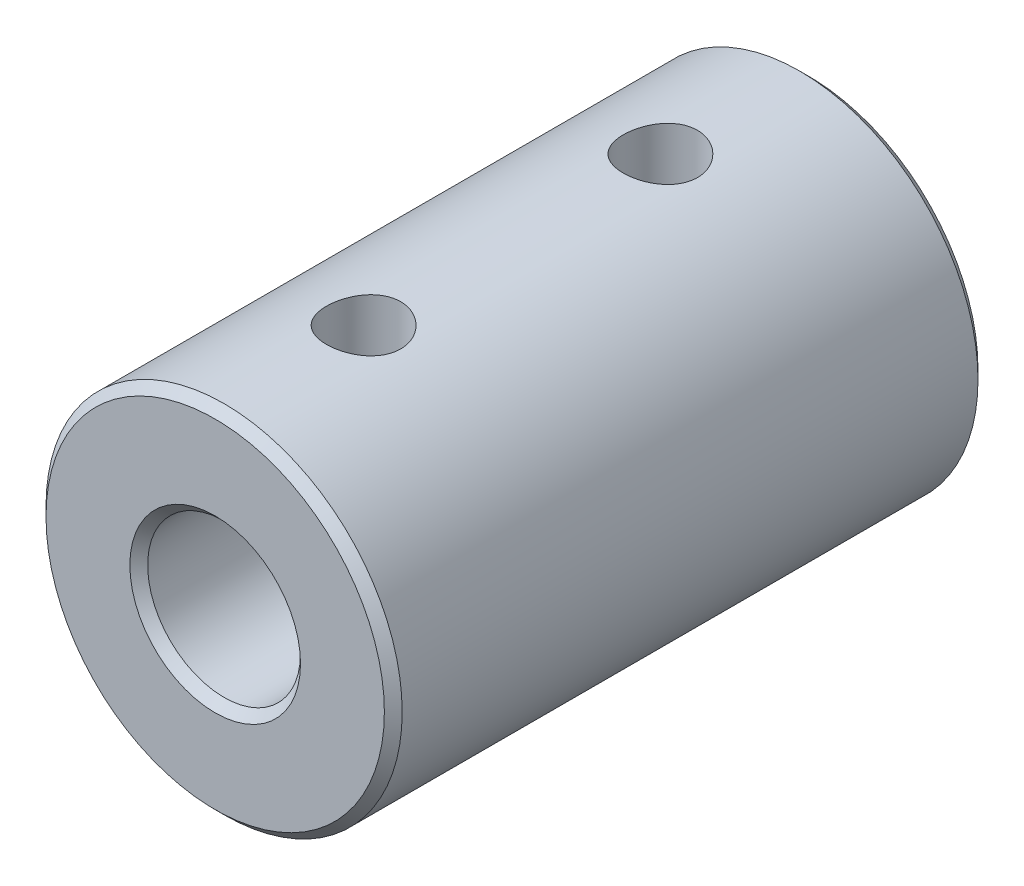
ISO-10303-21;
HEADER;
FILE_DESCRIPTION(('STEP AP214'),'2;1');
FILE_NAME('part.step','',(''),(''),'','','');
FILE_SCHEMA(('AUTOMOTIVE_DESIGN { 1 0 10303 214 1 1 1 1 }'));
ENDSEC;
DATA;
#1=APPLICATION_CONTEXT('core data for automotive mechanical design processes');
#2=APPLICATION_PROTOCOL_DEFINITION('international standard','automotive_design',2000,#1);
#3=PRODUCT_CONTEXT('',#1,'mechanical');
#4=PRODUCT('Part','Part','',(#3));
#5=PRODUCT_RELATED_PRODUCT_CATEGORY('part','',(#4));
#6=PRODUCT_DEFINITION_FORMATION('','',#4);
#7=PRODUCT_DEFINITION_CONTEXT('part definition',#1,'design');
#8=PRODUCT_DEFINITION('design','',#6,#7);
#9=PRODUCT_DEFINITION_SHAPE('','',#8);
#10=(LENGTH_UNIT() NAMED_UNIT(*) SI_UNIT(.MILLI.,.METRE.));
#11=(NAMED_UNIT(*) PLANE_ANGLE_UNIT() SI_UNIT($,.RADIAN.));
#12=(NAMED_UNIT(*) SI_UNIT($,.STERADIAN.) SOLID_ANGLE_UNIT());
#13=UNCERTAINTY_MEASURE_WITH_UNIT(LENGTH_MEASURE(1.E-05),#10,'distance_accuracy_value','');
#14=(GEOMETRIC_REPRESENTATION_CONTEXT(3) GLOBAL_UNCERTAINTY_ASSIGNED_CONTEXT((#13)) GLOBAL_UNIT_ASSIGNED_CONTEXT((#10,
#11,#12)) REPRESENTATION_CONTEXT('',''));
#15=CARTESIAN_POINT('',(0.,0.,0.));
#16=DIRECTION('',(0.,0.,1.));
#17=DIRECTION('',(1.,0.,0.));
#18=AXIS2_PLACEMENT_3D('',#15,#16,#17);
#19=CARTESIAN_POINT('',(0.,0.,10.));
#20=DIRECTION('',(0.,0.,1.));
#21=DIRECTION('',(1.,0.,0.));
#22=AXIS2_PLACEMENT_3D('',#19,#20,#21);
#23=PLANE('',#22);
#24=CARTESIAN_POINT('',(0.,0.,10.));
#25=DIRECTION('',(0.,0.,1.));
#26=DIRECTION('',(1.,0.,0.));
#27=AXIS2_PLACEMENT_3D('',#24,#25,#26);
#28=CIRCLE('',#27,5.7);
#29=CARTESIAN_POINT('',(-5.7,0.,10.));
#30=VERTEX_POINT('',#29);
#31=EDGE_CURVE('E10',#30,#30,#28,.T.);
#32=ORIENTED_EDGE('',*,*,#31,.T.);
#33=EDGE_LOOP('',(#32));
#34=FACE_BOUND('',#33,.T.);
#35=CARTESIAN_POINT('',(0.,0.,10.));
#36=DIRECTION('',(0.,0.,1.));
#37=DIRECTION('',(1.,0.,0.));
#38=AXIS2_PLACEMENT_3D('',#35,#36,#37);
#39=CIRCLE('',#38,2.875);
#40=CARTESIAN_POINT('',(2.875,0.,10.));
#41=VERTEX_POINT('',#40);
#42=EDGE_CURVE('E37',#41,#41,#39,.F.);
#43=ORIENTED_EDGE('',*,*,#42,.T.);
#44=EDGE_LOOP('',(#43));
#45=FACE_BOUND('',#44,.T.);
#46=ADVANCED_FACE('F30',(#34,#45),#23,.T.);
#47=CARTESIAN_POINT('',(0.,0.,-10.));
#48=DIRECTION('',(0.,0.,1.));
#49=DIRECTION('',(1.,0.,0.));
#50=AXIS2_PLACEMENT_3D('',#47,#48,#49);
#51=PLANE('',#50);
#52=CARTESIAN_POINT('',(0.,0.,-10.));
#53=DIRECTION('',(0.,0.,1.));
#54=DIRECTION('',(1.,0.,0.));
#55=AXIS2_PLACEMENT_3D('',#52,#53,#54);
#56=CIRCLE('',#55,2.875);
#57=CARTESIAN_POINT('',(2.875,0.,-10.));
#58=VERTEX_POINT('',#57);
#59=EDGE_CURVE('E56',#58,#58,#56,.T.);
#60=ORIENTED_EDGE('',*,*,#59,.T.);
#61=EDGE_LOOP('',(#60));
#62=FACE_BOUND('',#61,.T.);
#63=CARTESIAN_POINT('',(0.,0.,-10.));
#64=DIRECTION('',(0.,0.,1.));
#65=DIRECTION('',(1.,0.,0.));
#66=AXIS2_PLACEMENT_3D('',#63,#64,#65);
#67=CIRCLE('',#66,5.7);
#68=CARTESIAN_POINT('',(5.7,0.,-10.));
#69=VERTEX_POINT('',#68);
#70=EDGE_CURVE('E59',#69,#69,#67,.F.);
#71=ORIENTED_EDGE('',*,*,#70,.T.);
#72=EDGE_LOOP('',(#71));
#73=FACE_BOUND('',#72,.T.);
#74=ADVANCED_FACE('F105',(#62,#73),#51,.F.);
#75=CARTESIAN_POINT('',(0.,0.,10.));
#76=DIRECTION('',(0.,0.,-1.));
#77=DIRECTION('',(-1.,0.,0.));
#78=AXIS2_PLACEMENT_3D('',#75,#76,#77);
#79=CYLINDRICAL_SURFACE('',#78,6.);
#80=CARTESIAN_POINT('',(0.,0.,-9.7));
#81=DIRECTION('',(0.,0.,1.));
#82=DIRECTION('',(1.,0.,0.));
#83=AXIS2_PLACEMENT_3D('',#80,#81,#82);
#84=CIRCLE('',#83,6.);
#85=CARTESIAN_POINT('',(6.,0.,-9.7));
#86=VERTEX_POINT('',#85);
#87=EDGE_CURVE('E41',#86,#86,#84,.T.);
#88=ORIENTED_EDGE('',*,*,#87,.T.);
#89=EDGE_LOOP('',(#88));
#90=FACE_BOUND('',#89,.T.);
#91=CARTESIAN_POINT('',(0.,0.,9.7));
#92=DIRECTION('',(0.,0.,1.));
#93=DIRECTION('',(1.,0.,0.));
#94=AXIS2_PLACEMENT_3D('',#91,#92,#93);
#95=CIRCLE('',#94,6.);
#96=CARTESIAN_POINT('',(-6.,0.,9.7));
#97=VERTEX_POINT('',#96);
#98=EDGE_CURVE('E45',#97,#97,#95,.F.);
#99=ORIENTED_EDGE('',*,*,#98,.T.);
#100=EDGE_LOOP('',(#99));
#101=FACE_BOUND('',#100,.T.);
#102=CARTESIAN_POINT('',(0.,-6.,-3.75));
#103=CARTESIAN_POINT('',(0.0694090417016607,-5.99999871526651,-3.75000247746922));
#104=CARTESIAN_POINT('',(0.138848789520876,-5.99878328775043,-3.75580066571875));
#105=CARTESIAN_POINT('',(0.275761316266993,-5.9940520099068,-3.77881934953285));
#106=CARTESIAN_POINT('',(0.343232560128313,-5.99053441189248,-3.79604852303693));
#107=CARTESIAN_POINT('',(0.474209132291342,-5.98159109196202,-3.84137045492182));
#108=CARTESIAN_POINT('',(0.537718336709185,-5.97616727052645,-3.86945239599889));
#109=CARTESIAN_POINT('',(0.659120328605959,-5.96399927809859,-3.93564960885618));
#110=CARTESIAN_POINT('',(0.717013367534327,-5.95725516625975,-3.97376443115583));
#111=CARTESIAN_POINT('',(0.826390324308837,-5.9430770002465,-4.05953634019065));
#112=CARTESIAN_POINT('',(0.877780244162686,-5.93563505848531,-4.10731200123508));
#113=CARTESIAN_POINT('',(0.971877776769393,-5.92095657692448,-4.21079465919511));
#114=CARTESIAN_POINT('',(1.01458467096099,-5.91372005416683,-4.26650231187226));
#115=CARTESIAN_POINT('',(1.09051031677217,-5.90019442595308,-4.38495196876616));
#116=CARTESIAN_POINT('',(1.12363054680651,-5.89391545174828,-4.44775838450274));
#117=CARTESIAN_POINT('',(1.17881119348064,-5.8831284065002,-4.57819745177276));
#118=CARTESIAN_POINT('',(1.20087280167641,-5.87862014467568,-4.64582958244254));
#119=CARTESIAN_POINT('',(1.23300240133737,-5.87196500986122,-4.78298523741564));
#120=CARTESIAN_POINT('',(1.24323597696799,-5.86978556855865,-4.85246835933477));
#121=CARTESIAN_POINT('',(1.25193357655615,-5.86793690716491,-4.99219684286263));
#122=CARTESIAN_POINT('',(1.25039890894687,-5.86826740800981,-5.0624421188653));
#123=CARTESIAN_POINT('',(1.23573719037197,-5.87137174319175,-5.20048102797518));
#124=CARTESIAN_POINT('',(1.2228010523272,-5.87410533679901,-5.26829597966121));
#125=CARTESIAN_POINT('',(1.18600543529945,-5.88164437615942,-5.40077150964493));
#126=CARTESIAN_POINT('',(1.16214539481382,-5.88644992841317,-5.46543192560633));
#127=CARTESIAN_POINT('',(1.10400003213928,-5.89763191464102,-5.59030722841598));
#128=CARTESIAN_POINT('',(1.06964002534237,-5.90401953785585,-5.65048629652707));
#129=CARTESIAN_POINT('',(0.991522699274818,-5.91763890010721,-5.76429574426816));
#130=CARTESIAN_POINT('',(0.947764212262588,-5.92487074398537,-5.81792530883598));
#131=CARTESIAN_POINT('',(0.851074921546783,-5.93953730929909,-5.91821396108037));
#132=CARTESIAN_POINT('',(0.797981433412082,-5.94697323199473,-5.96471616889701));
#133=CARTESIAN_POINT('',(0.684667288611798,-5.96108088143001,-6.04818044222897));
#134=CARTESIAN_POINT('',(0.624446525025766,-5.96775259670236,-6.0851423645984));
#135=CARTESIAN_POINT('',(0.498405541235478,-5.97959870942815,-6.14851008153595));
#136=CARTESIAN_POINT('',(0.4325754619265,-5.98477039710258,-6.17489680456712));
#137=CARTESIAN_POINT('',(0.297284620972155,-5.99301338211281,-6.21619170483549));
#138=CARTESIAN_POINT('',(0.227824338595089,-5.99608495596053,-6.2311013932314));
#139=CARTESIAN_POINT('',(0.0885918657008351,-5.99974275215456,-6.24879425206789));
#140=CARTESIAN_POINT('',(0.0188480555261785,-6.00037293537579,-6.25179194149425));
#141=CARTESIAN_POINT('',(-0.120143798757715,-5.99919952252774,-6.2461550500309));
#142=CARTESIAN_POINT('',(-0.189391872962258,-5.99739607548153,-6.2375211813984));
#143=CARTESIAN_POINT('',(-0.324726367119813,-5.99158564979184,-6.20904434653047));
#144=CARTESIAN_POINT('',(-0.390837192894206,-5.98760052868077,-6.18931251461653));
#145=CARTESIAN_POINT('',(-0.518811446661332,-5.97787227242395,-6.13932213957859));
#146=CARTESIAN_POINT('',(-0.580674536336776,-5.97212899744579,-6.10906275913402));
#147=CARTESIAN_POINT('',(-0.699294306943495,-5.95941241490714,-6.03841962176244));
#148=CARTESIAN_POINT('',(-0.755973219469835,-5.9524239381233,-5.99790807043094));
#149=CARTESIAN_POINT('',(-0.861805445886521,-5.93802568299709,-5.90808043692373));
#150=CARTESIAN_POINT('',(-0.910957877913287,-5.93061585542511,-5.85876332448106));
#151=CARTESIAN_POINT('',(-1.0011786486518,-5.91606024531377,-5.7517444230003));
#152=CARTESIAN_POINT('',(-1.04209914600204,-5.90892089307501,-5.69391696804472));
#153=CARTESIAN_POINT('',(-1.11364719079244,-5.89585601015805,-5.57208371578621));
#154=CARTESIAN_POINT('',(-1.14427516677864,-5.88993042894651,-5.50807817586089));
#155=CARTESIAN_POINT('',(-1.19417246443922,-5.88001700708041,-5.37603880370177));
#156=CARTESIAN_POINT('',(-1.21350309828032,-5.87601872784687,-5.30802896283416));
#157=CARTESIAN_POINT('',(-1.24044038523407,-5.87039184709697,-5.16963344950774));
#158=CARTESIAN_POINT('',(-1.24804871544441,-5.86876290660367,-5.09924811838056));
#159=CARTESIAN_POINT('',(-1.25125926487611,-5.86807907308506,-4.95958659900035));
#160=CARTESIAN_POINT('',(-1.24709542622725,-5.86897402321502,-4.89031592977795));
#161=CARTESIAN_POINT('',(-1.22739905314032,-5.87312447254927,-4.75348599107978));
#162=CARTESIAN_POINT('',(-1.21186662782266,-5.87637994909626,-4.68592670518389));
#163=CARTESIAN_POINT('',(-1.16998217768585,-5.88486132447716,-4.55460222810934));
#164=CARTESIAN_POINT('',(-1.14366117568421,-5.8900815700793,-4.49082675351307));
#165=CARTESIAN_POINT('',(-1.08097457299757,-5.90190705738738,-4.36856122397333));
#166=CARTESIAN_POINT('',(-1.0446080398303,-5.9085124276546,-4.31007166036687));
#167=CARTESIAN_POINT('',(-0.962073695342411,-5.92251579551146,-4.19887837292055));
#168=CARTESIAN_POINT('',(-0.915737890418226,-5.92992613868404,-4.14630087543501));
#169=CARTESIAN_POINT('',(-0.814924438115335,-5.94461839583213,-4.04959050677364));
#170=CARTESIAN_POINT('',(-0.760444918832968,-5.9519002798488,-4.00545958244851));
#171=CARTESIAN_POINT('',(-0.644134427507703,-5.96561444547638,-3.92641142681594));
#172=CARTESIAN_POINT('',(-0.582225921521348,-5.97203596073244,-3.89160632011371));
#173=CARTESIAN_POINT('',(-0.453319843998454,-5.98319908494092,-3.83294977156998));
#174=CARTESIAN_POINT('',(-0.386326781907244,-5.98794216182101,-3.80908875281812));
#175=CARTESIAN_POINT('',(-0.266015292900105,-5.99432499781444,-3.77745972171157));
#176=CARTESIAN_POINT('',(-0.213367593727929,-5.99644035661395,-3.76718123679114));
#177=CARTESIAN_POINT('',(-0.107152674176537,-5.99927832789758,-3.75345054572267));
#178=CARTESIAN_POINT('',(-0.0535854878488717,-6.00000099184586,-3.74999808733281));
#179=CARTESIAN_POINT('',(0.,-6.,-3.75));
#180=B_SPLINE_CURVE_WITH_KNOTS('',3,(#102,#103,#104,#105,#106,#107,#108,#109,#110,#111,#112,
#113,#114,#115,#116,#117,#118,#119,#120,#121,#122,#123,#124,#125,#126,#127,#128,#129,#130,#131,
#132,#133,#134,#135,#136,#137,#138,#139,#140,#141,#142,#143,#144,#145,#146,#147,#148,#149,#150,
#151,#152,#153,#154,#155,#156,#157,#158,#159,#160,#161,#162,#163,#164,#165,#166,#167,#168,#169,
#170,#171,#172,#173,#174,#175,#176,#177,#178,#179),.UNSPECIFIED.,.T.,.F.,(4,2,2,2,2,2,2,2,2,2,2,
2,2,2,2,2,2,2,2,2,2,2,2,2,2,2,2,2,2,2,2,2,2,2,2,2,2,2,4),(0.,0.208031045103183,
0.416220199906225,0.624202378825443,0.83217524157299,1.04287526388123,1.25359271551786,
1.46640449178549,1.6791933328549,1.88896575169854,2.09871484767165,2.3050171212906,
2.5113300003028,2.71914592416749,2.92698768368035,3.13889526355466,3.35080602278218,
3.56309724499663,3.77536051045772,3.98378339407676,4.19219351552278,4.39855286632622,
4.60492863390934,4.81401583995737,5.02312752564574,5.23571263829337,5.4482888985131,
5.65970050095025,5.87108185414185,6.07829223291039,6.28550062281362,6.49211731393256,
6.6987531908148,6.9091902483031,7.1196757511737,7.33258864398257,7.54531486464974,
7.70592588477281,7.86653096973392),.UNSPECIFIED.);
#181=CARTESIAN_POINT('',(0.,-6.,-3.75));
#182=VERTEX_POINT('',#181);
#183=EDGE_CURVE('E96',#182,#182,#180,.T.);
#184=ORIENTED_EDGE('',*,*,#183,.T.);
#185=EDGE_LOOP('',(#184));
#186=FACE_BOUND('',#185,.T.);
#187=CARTESIAN_POINT('',(0.,6.,-3.75));
#188=CARTESIAN_POINT('',(-0.0694090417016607,5.99999871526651,-3.75000247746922));
#189=CARTESIAN_POINT('',(-0.138848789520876,5.99878328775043,-3.75580066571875));
#190=CARTESIAN_POINT('',(-0.275761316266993,5.9940520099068,-3.77881934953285));
#191=CARTESIAN_POINT('',(-0.343232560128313,5.99053441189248,-3.79604852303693));
#192=CARTESIAN_POINT('',(-0.474209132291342,5.98159109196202,-3.84137045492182));
#193=CARTESIAN_POINT('',(-0.537718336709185,5.97616727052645,-3.86945239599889));
#194=CARTESIAN_POINT('',(-0.659120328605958,5.96399927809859,-3.93564960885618));
#195=CARTESIAN_POINT('',(-0.717013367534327,5.95725516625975,-3.97376443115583));
#196=CARTESIAN_POINT('',(-0.826390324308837,5.9430770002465,-4.05953634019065));
#197=CARTESIAN_POINT('',(-0.877780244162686,5.93563505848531,-4.10731200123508));
#198=CARTESIAN_POINT('',(-0.971877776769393,5.92095657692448,-4.21079465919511));
#199=CARTESIAN_POINT('',(-1.01458467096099,5.91372005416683,-4.26650231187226));
#200=CARTESIAN_POINT('',(-1.09051031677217,5.90019442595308,-4.38495196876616));
#201=CARTESIAN_POINT('',(-1.12363054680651,5.89391545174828,-4.44775838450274));
#202=CARTESIAN_POINT('',(-1.17881119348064,5.8831284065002,-4.57819745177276));
#203=CARTESIAN_POINT('',(-1.20087280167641,5.87862014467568,-4.64582958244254));
#204=CARTESIAN_POINT('',(-1.23300240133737,5.87196500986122,-4.78298523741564));
#205=CARTESIAN_POINT('',(-1.24323597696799,5.86978556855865,-4.85246835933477));
#206=CARTESIAN_POINT('',(-1.25193357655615,5.86793690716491,-4.99219684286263));
#207=CARTESIAN_POINT('',(-1.25039890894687,5.86826740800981,-5.0624421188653));
#208=CARTESIAN_POINT('',(-1.23573719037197,5.87137174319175,-5.20048102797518));
#209=CARTESIAN_POINT('',(-1.2228010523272,5.87410533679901,-5.26829597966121));
#210=CARTESIAN_POINT('',(-1.18600543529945,5.88164437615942,-5.40077150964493));
#211=CARTESIAN_POINT('',(-1.16214539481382,5.88644992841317,-5.46543192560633));
#212=CARTESIAN_POINT('',(-1.10400003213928,5.89763191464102,-5.59030722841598));
#213=CARTESIAN_POINT('',(-1.06964002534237,5.90401953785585,-5.65048629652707));
#214=CARTESIAN_POINT('',(-0.991522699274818,5.91763890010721,-5.76429574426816));
#215=CARTESIAN_POINT('',(-0.947764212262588,5.92487074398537,-5.81792530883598));
#216=CARTESIAN_POINT('',(-0.851074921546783,5.93953730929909,-5.91821396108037));
#217=CARTESIAN_POINT('',(-0.797981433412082,5.94697323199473,-5.96471616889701));
#218=CARTESIAN_POINT('',(-0.684667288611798,5.96108088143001,-6.04818044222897));
#219=CARTESIAN_POINT('',(-0.624446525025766,5.96775259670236,-6.0851423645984));
#220=CARTESIAN_POINT('',(-0.498405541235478,5.97959870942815,-6.14851008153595));
#221=CARTESIAN_POINT('',(-0.4325754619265,5.98477039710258,-6.17489680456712));
#222=CARTESIAN_POINT('',(-0.297284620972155,5.99301338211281,-6.21619170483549));
#223=CARTESIAN_POINT('',(-0.227824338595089,5.99608495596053,-6.2311013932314));
#224=CARTESIAN_POINT('',(-0.0885918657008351,5.99974275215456,-6.24879425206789));
#225=CARTESIAN_POINT('',(-0.0188480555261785,6.00037293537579,-6.25179194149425));
#226=CARTESIAN_POINT('',(0.120143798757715,5.99919952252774,-6.2461550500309));
#227=CARTESIAN_POINT('',(0.189391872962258,5.99739607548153,-6.2375211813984));
#228=CARTESIAN_POINT('',(0.324726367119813,5.99158564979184,-6.20904434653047));
#229=CARTESIAN_POINT('',(0.390837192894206,5.98760052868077,-6.18931251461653));
#230=CARTESIAN_POINT('',(0.518811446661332,5.97787227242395,-6.13932213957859));
#231=CARTESIAN_POINT('',(0.580674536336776,5.97212899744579,-6.10906275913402));
#232=CARTESIAN_POINT('',(0.699294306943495,5.95941241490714,-6.03841962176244));
#233=CARTESIAN_POINT('',(0.755973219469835,5.9524239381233,-5.99790807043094));
#234=CARTESIAN_POINT('',(0.861805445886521,5.93802568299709,-5.90808043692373));
#235=CARTESIAN_POINT('',(0.910957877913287,5.93061585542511,-5.85876332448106));
#236=CARTESIAN_POINT('',(1.0011786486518,5.91606024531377,-5.7517444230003));
#237=CARTESIAN_POINT('',(1.04209914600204,5.90892089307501,-5.69391696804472));
#238=CARTESIAN_POINT('',(1.11364719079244,5.89585601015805,-5.57208371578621));
#239=CARTESIAN_POINT('',(1.14427516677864,5.88993042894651,-5.50807817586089));
#240=CARTESIAN_POINT('',(1.19417246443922,5.88001700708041,-5.37603880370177));
#241=CARTESIAN_POINT('',(1.21350309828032,5.87601872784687,-5.30802896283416));
#242=CARTESIAN_POINT('',(1.24044038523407,5.87039184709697,-5.16963344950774));
#243=CARTESIAN_POINT('',(1.24804871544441,5.86876290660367,-5.09924811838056));
#244=CARTESIAN_POINT('',(1.25125926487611,5.86807907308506,-4.95958659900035));
#245=CARTESIAN_POINT('',(1.24709542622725,5.86897402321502,-4.89031592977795));
#246=CARTESIAN_POINT('',(1.22739905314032,5.87312447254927,-4.75348599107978));
#247=CARTESIAN_POINT('',(1.21186662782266,5.87637994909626,-4.68592670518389));
#248=CARTESIAN_POINT('',(1.16998217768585,5.88486132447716,-4.55460222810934));
#249=CARTESIAN_POINT('',(1.14366117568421,5.8900815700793,-4.49082675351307));
#250=CARTESIAN_POINT('',(1.08097457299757,5.90190705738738,-4.36856122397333));
#251=CARTESIAN_POINT('',(1.0446080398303,5.9085124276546,-4.31007166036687));
#252=CARTESIAN_POINT('',(0.962073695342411,5.92251579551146,-4.19887837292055));
#253=CARTESIAN_POINT('',(0.915737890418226,5.92992613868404,-4.14630087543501));
#254=CARTESIAN_POINT('',(0.814924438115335,5.94461839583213,-4.04959050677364));
#255=CARTESIAN_POINT('',(0.760444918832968,5.9519002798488,-4.00545958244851));
#256=CARTESIAN_POINT('',(0.644134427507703,5.96561444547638,-3.92641142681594));
#257=CARTESIAN_POINT('',(0.582225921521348,5.97203596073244,-3.89160632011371));
#258=CARTESIAN_POINT('',(0.453319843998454,5.98319908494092,-3.83294977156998));
#259=CARTESIAN_POINT('',(0.386326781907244,5.98794216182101,-3.80908875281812));
#260=CARTESIAN_POINT('',(0.266015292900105,5.99432499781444,-3.77745972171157));
#261=CARTESIAN_POINT('',(0.213367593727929,5.99644035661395,-3.76718123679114));
#262=CARTESIAN_POINT('',(0.107152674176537,5.99927832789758,-3.75345054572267));
#263=CARTESIAN_POINT('',(0.0535854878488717,6.00000099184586,-3.74999808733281));
#264=CARTESIAN_POINT('',(0.,6.,-3.75));
#265=B_SPLINE_CURVE_WITH_KNOTS('',3,(#187,#188,#189,#190,#191,#192,#193,#194,#195,#196,#197,
#198,#199,#200,#201,#202,#203,#204,#205,#206,#207,#208,#209,#210,#211,#212,#213,#214,#215,#216,
#217,#218,#219,#220,#221,#222,#223,#224,#225,#226,#227,#228,#229,#230,#231,#232,#233,#234,#235,
#236,#237,#238,#239,#240,#241,#242,#243,#244,#245,#246,#247,#248,#249,#250,#251,#252,#253,#254,
#255,#256,#257,#258,#259,#260,#261,#262,#263,#264),.UNSPECIFIED.,.T.,.F.,(4,2,2,2,2,2,2,2,2,2,2,
2,2,2,2,2,2,2,2,2,2,2,2,2,2,2,2,2,2,2,2,2,2,2,2,2,2,2,4),(0.,0.208031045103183,
0.416220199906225,0.624202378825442,0.83217524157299,1.04287526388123,1.25359271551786,
1.46640449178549,1.6791933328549,1.88896575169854,2.09871484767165,2.3050171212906,
2.5113300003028,2.71914592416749,2.92698768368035,3.13889526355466,3.35080602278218,
3.56309724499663,3.77536051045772,3.98378339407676,4.19219351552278,4.39855286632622,
4.60492863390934,4.81401583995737,5.02312752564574,5.23571263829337,5.4482888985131,
5.65970050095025,5.87108185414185,6.07829223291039,6.28550062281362,6.49211731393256,
6.6987531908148,6.9091902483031,7.1196757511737,7.33258864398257,7.54531486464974,
7.70592588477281,7.86653096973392),.UNSPECIFIED.);
#266=CARTESIAN_POINT('',(0.,6.,-3.75));
#267=VERTEX_POINT('',#266);
#268=EDGE_CURVE('E70',#267,#267,#265,.T.);
#269=ORIENTED_EDGE('',*,*,#268,.T.);
#270=EDGE_LOOP('',(#269));
#271=FACE_BOUND('',#270,.T.);
#272=CARTESIAN_POINT('',(0.,-6.,6.25));
#273=CARTESIAN_POINT('',(0.0694090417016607,-5.99999871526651,6.24999752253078));
#274=CARTESIAN_POINT('',(0.138848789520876,-5.99878328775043,6.24419933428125));
#275=CARTESIAN_POINT('',(0.275761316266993,-5.9940520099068,6.22118065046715));
#276=CARTESIAN_POINT('',(0.343232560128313,-5.99053441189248,6.20395147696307));
#277=CARTESIAN_POINT('',(0.474209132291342,-5.98159109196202,6.15862954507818));
#278=CARTESIAN_POINT('',(0.537718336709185,-5.97616727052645,6.13054760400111));
#279=CARTESIAN_POINT('',(0.659120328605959,-5.96399927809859,6.06435039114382));
#280=CARTESIAN_POINT('',(0.717013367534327,-5.95725516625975,6.02623556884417));
#281=CARTESIAN_POINT('',(0.826390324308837,-5.9430770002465,5.94046365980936));
#282=CARTESIAN_POINT('',(0.877780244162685,-5.93563505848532,5.89268799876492));
#283=CARTESIAN_POINT('',(0.971877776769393,-5.92095657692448,5.78920534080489));
#284=CARTESIAN_POINT('',(1.01458467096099,-5.91372005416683,5.73349768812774));
#285=CARTESIAN_POINT('',(1.09051031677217,-5.90019442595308,5.61504803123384));
#286=CARTESIAN_POINT('',(1.12363054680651,-5.89391545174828,5.55224161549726));
#287=CARTESIAN_POINT('',(1.17881119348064,-5.8831284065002,5.42180254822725));
#288=CARTESIAN_POINT('',(1.20087280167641,-5.87862014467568,5.35417041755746));
#289=CARTESIAN_POINT('',(1.23300240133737,-5.87196500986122,5.21701476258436));
#290=CARTESIAN_POINT('',(1.24323597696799,-5.86978556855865,5.14753164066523));
#291=CARTESIAN_POINT('',(1.25193357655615,-5.86793690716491,5.00780315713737));
#292=CARTESIAN_POINT('',(1.25039890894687,-5.86826740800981,4.9375578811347));
#293=CARTESIAN_POINT('',(1.23573719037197,-5.87137174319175,4.79951897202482));
#294=CARTESIAN_POINT('',(1.2228010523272,-5.87410533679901,4.73170402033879));
#295=CARTESIAN_POINT('',(1.18600543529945,-5.88164437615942,4.59922849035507));
#296=CARTESIAN_POINT('',(1.16214539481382,-5.88644992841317,4.53456807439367));
#297=CARTESIAN_POINT('',(1.10400003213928,-5.89763191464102,4.40969277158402));
#298=CARTESIAN_POINT('',(1.06964002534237,-5.90401953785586,4.34951370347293));
#299=CARTESIAN_POINT('',(0.991522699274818,-5.91763890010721,4.23570425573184));
#300=CARTESIAN_POINT('',(0.947764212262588,-5.92487074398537,4.18207469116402));
#301=CARTESIAN_POINT('',(0.851074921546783,-5.93953730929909,4.08178603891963));
#302=CARTESIAN_POINT('',(0.797981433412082,-5.94697323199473,4.03528383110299));
#303=CARTESIAN_POINT('',(0.684667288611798,-5.96108088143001,3.95181955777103));
#304=CARTESIAN_POINT('',(0.624446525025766,-5.96775259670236,3.9148576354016));
#305=CARTESIAN_POINT('',(0.498405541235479,-5.97959870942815,3.85148991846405));
#306=CARTESIAN_POINT('',(0.4325754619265,-5.98477039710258,3.82510319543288));
#307=CARTESIAN_POINT('',(0.297284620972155,-5.99301338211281,3.78380829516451));
#308=CARTESIAN_POINT('',(0.22782433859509,-5.99608495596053,3.7688986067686));
#309=CARTESIAN_POINT('',(0.0885918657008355,-5.99974275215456,3.75120574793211));
#310=CARTESIAN_POINT('',(0.0188480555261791,-6.00037293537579,3.74820805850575));
#311=CARTESIAN_POINT('',(-0.120143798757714,-5.99919952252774,3.7538449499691));
#312=CARTESIAN_POINT('',(-0.189391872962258,-5.99739607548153,3.7624788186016));
#313=CARTESIAN_POINT('',(-0.324726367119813,-5.99158564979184,3.79095565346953));
#314=CARTESIAN_POINT('',(-0.390837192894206,-5.98760052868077,3.81068748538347));
#315=CARTESIAN_POINT('',(-0.518811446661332,-5.97787227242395,3.86067786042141));
#316=CARTESIAN_POINT('',(-0.580674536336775,-5.97212899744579,3.89093724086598));
#317=CARTESIAN_POINT('',(-0.699294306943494,-5.95941241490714,3.96158037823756));
#318=CARTESIAN_POINT('',(-0.755973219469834,-5.9524239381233,4.00209192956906));
#319=CARTESIAN_POINT('',(-0.86180544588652,-5.93802568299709,4.09191956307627));
#320=CARTESIAN_POINT('',(-0.910957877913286,-5.93061585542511,4.14123667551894));
#321=CARTESIAN_POINT('',(-1.0011786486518,-5.91606024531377,4.2482555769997));
#322=CARTESIAN_POINT('',(-1.04209914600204,-5.90892089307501,4.30608303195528));
#323=CARTESIAN_POINT('',(-1.11364719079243,-5.89585601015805,4.42791628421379));
#324=CARTESIAN_POINT('',(-1.14427516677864,-5.88993042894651,4.49192182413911));
#325=CARTESIAN_POINT('',(-1.19417246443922,-5.88001700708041,4.62396119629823));
#326=CARTESIAN_POINT('',(-1.21350309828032,-5.87601872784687,4.69197103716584));
#327=CARTESIAN_POINT('',(-1.24044038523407,-5.87039184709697,4.83036655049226));
#328=CARTESIAN_POINT('',(-1.24804871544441,-5.86876290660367,4.90075188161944));
#329=CARTESIAN_POINT('',(-1.25125926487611,-5.86807907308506,5.04041340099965));
#330=CARTESIAN_POINT('',(-1.24709542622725,-5.86897402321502,5.10968407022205));
#331=CARTESIAN_POINT('',(-1.22739905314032,-5.87312447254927,5.24651400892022));
#332=CARTESIAN_POINT('',(-1.21186662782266,-5.87637994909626,5.31407329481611));
#333=CARTESIAN_POINT('',(-1.16998217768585,-5.88486132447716,5.44539777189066));
#334=CARTESIAN_POINT('',(-1.14366117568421,-5.8900815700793,5.50917324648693));
#335=CARTESIAN_POINT('',(-1.08097457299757,-5.90190705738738,5.63143877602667));
#336=CARTESIAN_POINT('',(-1.0446080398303,-5.9085124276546,5.68992833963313));
#337=CARTESIAN_POINT('',(-0.962073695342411,-5.92251579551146,5.80112162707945));
#338=CARTESIAN_POINT('',(-0.915737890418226,-5.92992613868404,5.85369912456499));
#339=CARTESIAN_POINT('',(-0.814924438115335,-5.94461839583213,5.95040949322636));
#340=CARTESIAN_POINT('',(-0.760444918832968,-5.9519002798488,5.99454041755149));
#341=CARTESIAN_POINT('',(-0.644134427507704,-5.96561444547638,6.07358857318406));
#342=CARTESIAN_POINT('',(-0.582225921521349,-5.97203596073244,6.10839367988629));
#343=CARTESIAN_POINT('',(-0.453319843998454,-5.98319908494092,6.16705022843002));
#344=CARTESIAN_POINT('',(-0.386326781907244,-5.98794216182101,6.19091124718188));
#345=CARTESIAN_POINT('',(-0.266015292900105,-5.99432499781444,6.22254027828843));
#346=CARTESIAN_POINT('',(-0.213367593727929,-5.99644035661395,6.23281876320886));
#347=CARTESIAN_POINT('',(-0.107152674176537,-5.99927832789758,6.24654945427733));
#348=CARTESIAN_POINT('',(-0.0535854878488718,-6.00000099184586,6.25000191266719));
#349=CARTESIAN_POINT('',(0.,-6.,6.25));
#350=B_SPLINE_CURVE_WITH_KNOTS('',3,(#272,#273,#274,#275,#276,#277,#278,#279,#280,#281,#282,
#283,#284,#285,#286,#287,#288,#289,#290,#291,#292,#293,#294,#295,#296,#297,#298,#299,#300,#301,
#302,#303,#304,#305,#306,#307,#308,#309,#310,#311,#312,#313,#314,#315,#316,#317,#318,#319,#320,
#321,#322,#323,#324,#325,#326,#327,#328,#329,#330,#331,#332,#333,#334,#335,#336,#337,#338,#339,
#340,#341,#342,#343,#344,#345,#346,#347,#348,#349),.UNSPECIFIED.,.T.,.F.,(4,2,2,2,2,2,2,2,2,2,2,
2,2,2,2,2,2,2,2,2,2,2,2,2,2,2,2,2,2,2,2,2,2,2,2,2,2,2,4),(0.,0.208031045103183,
0.416220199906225,0.624202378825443,0.83217524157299,1.04287526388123,1.25359271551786,
1.46640449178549,1.6791933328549,1.88896575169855,2.09871484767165,2.3050171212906,
2.5113300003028,2.71914592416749,2.92698768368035,3.13889526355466,3.35080602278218,
3.56309724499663,3.77536051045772,3.98378339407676,4.19219351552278,4.39855286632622,
4.60492863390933,4.81401583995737,5.02312752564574,5.23571263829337,5.44828889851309,
5.65970050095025,5.87108185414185,6.07829223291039,6.28550062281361,6.49211731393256,
6.6987531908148,6.90919024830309,7.1196757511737,7.33258864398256,7.54531486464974,
7.7059258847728,7.86653096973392),.UNSPECIFIED.);
#351=CARTESIAN_POINT('',(0.,-6.,6.25));
#352=VERTEX_POINT('',#351);
#353=EDGE_CURVE('E62',#352,#352,#350,.T.);
#354=ORIENTED_EDGE('',*,*,#353,.T.);
#355=EDGE_LOOP('',(#354));
#356=FACE_BOUND('',#355,.T.);
#357=CARTESIAN_POINT('',(0.,6.,6.25));
#358=CARTESIAN_POINT('',(-0.0694090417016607,5.99999871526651,6.24999752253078));
#359=CARTESIAN_POINT('',(-0.138848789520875,5.99878328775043,6.24419933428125));
#360=CARTESIAN_POINT('',(-0.275761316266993,5.9940520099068,6.22118065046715));
#361=CARTESIAN_POINT('',(-0.343232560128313,5.99053441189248,6.20395147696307));
#362=CARTESIAN_POINT('',(-0.474209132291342,5.98159109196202,6.15862954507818));
#363=CARTESIAN_POINT('',(-0.537718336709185,5.97616727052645,6.13054760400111));
#364=CARTESIAN_POINT('',(-0.659120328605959,5.96399927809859,6.06435039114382));
#365=CARTESIAN_POINT('',(-0.717013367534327,5.95725516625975,6.02623556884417));
#366=CARTESIAN_POINT('',(-0.826390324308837,5.9430770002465,5.94046365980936));
#367=CARTESIAN_POINT('',(-0.877780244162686,5.93563505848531,5.89268799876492));
#368=CARTESIAN_POINT('',(-0.971877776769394,5.92095657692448,5.78920534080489));
#369=CARTESIAN_POINT('',(-1.01458467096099,5.91372005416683,5.73349768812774));
#370=CARTESIAN_POINT('',(-1.09051031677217,5.90019442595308,5.61504803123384));
#371=CARTESIAN_POINT('',(-1.12363054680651,5.89391545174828,5.55224161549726));
#372=CARTESIAN_POINT('',(-1.17881119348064,5.8831284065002,5.42180254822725));
#373=CARTESIAN_POINT('',(-1.20087280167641,5.87862014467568,5.35417041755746));
#374=CARTESIAN_POINT('',(-1.23300240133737,5.87196500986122,5.21701476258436));
#375=CARTESIAN_POINT('',(-1.24323597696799,5.86978556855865,5.14753164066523));
#376=CARTESIAN_POINT('',(-1.25193357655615,5.86793690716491,5.00780315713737));
#377=CARTESIAN_POINT('',(-1.25039890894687,5.86826740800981,4.9375578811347));
#378=CARTESIAN_POINT('',(-1.23573719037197,5.87137174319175,4.79951897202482));
#379=CARTESIAN_POINT('',(-1.2228010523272,5.87410533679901,4.73170402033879));
#380=CARTESIAN_POINT('',(-1.18600543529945,5.88164437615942,4.59922849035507));
#381=CARTESIAN_POINT('',(-1.16214539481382,5.88644992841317,4.53456807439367));
#382=CARTESIAN_POINT('',(-1.10400003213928,5.89763191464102,4.40969277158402));
#383=CARTESIAN_POINT('',(-1.06964002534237,5.90401953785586,4.34951370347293));
#384=CARTESIAN_POINT('',(-0.991522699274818,5.91763890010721,4.23570425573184));
#385=CARTESIAN_POINT('',(-0.947764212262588,5.92487074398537,4.18207469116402));
#386=CARTESIAN_POINT('',(-0.851074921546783,5.93953730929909,4.08178603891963));
#387=CARTESIAN_POINT('',(-0.797981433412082,5.94697323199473,4.03528383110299));
#388=CARTESIAN_POINT('',(-0.684667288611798,5.96108088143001,3.95181955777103));
#389=CARTESIAN_POINT('',(-0.624446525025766,5.96775259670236,3.9148576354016));
#390=CARTESIAN_POINT('',(-0.498405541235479,5.97959870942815,3.85148991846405));
#391=CARTESIAN_POINT('',(-0.4325754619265,5.98477039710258,3.82510319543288));
#392=CARTESIAN_POINT('',(-0.297284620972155,5.99301338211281,3.78380829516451));
#393=CARTESIAN_POINT('',(-0.22782433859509,5.99608495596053,3.7688986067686));
#394=CARTESIAN_POINT('',(-0.0885918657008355,5.99974275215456,3.75120574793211));
#395=CARTESIAN_POINT('',(-0.0188480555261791,6.00037293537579,3.74820805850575));
#396=CARTESIAN_POINT('',(0.120143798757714,5.99919952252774,3.7538449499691));
#397=CARTESIAN_POINT('',(0.189391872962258,5.99739607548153,3.7624788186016));
#398=CARTESIAN_POINT('',(0.324726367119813,5.99158564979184,3.79095565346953));
#399=CARTESIAN_POINT('',(0.390837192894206,5.98760052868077,3.81068748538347));
#400=CARTESIAN_POINT('',(0.518811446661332,5.97787227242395,3.86067786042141));
#401=CARTESIAN_POINT('',(0.580674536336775,5.97212899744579,3.89093724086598));
#402=CARTESIAN_POINT('',(0.699294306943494,5.95941241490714,3.96158037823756));
#403=CARTESIAN_POINT('',(0.755973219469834,5.9524239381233,4.00209192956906));
#404=CARTESIAN_POINT('',(0.86180544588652,5.93802568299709,4.09191956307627));
#405=CARTESIAN_POINT('',(0.910957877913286,5.93061585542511,4.14123667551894));
#406=CARTESIAN_POINT('',(1.0011786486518,5.91606024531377,4.2482555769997));
#407=CARTESIAN_POINT('',(1.04209914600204,5.90892089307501,4.30608303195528));
#408=CARTESIAN_POINT('',(1.11364719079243,5.89585601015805,4.42791628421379));
#409=CARTESIAN_POINT('',(1.14427516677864,5.88993042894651,4.49192182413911));
#410=CARTESIAN_POINT('',(1.19417246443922,5.88001700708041,4.62396119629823));
#411=CARTESIAN_POINT('',(1.21350309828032,5.87601872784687,4.69197103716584));
#412=CARTESIAN_POINT('',(1.24044038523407,5.87039184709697,4.83036655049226));
#413=CARTESIAN_POINT('',(1.24804871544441,5.86876290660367,4.90075188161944));
#414=CARTESIAN_POINT('',(1.25125926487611,5.86807907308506,5.04041340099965));
#415=CARTESIAN_POINT('',(1.24709542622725,5.86897402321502,5.10968407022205));
#416=CARTESIAN_POINT('',(1.22739905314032,5.87312447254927,5.24651400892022));
#417=CARTESIAN_POINT('',(1.21186662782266,5.87637994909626,5.31407329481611));
#418=CARTESIAN_POINT('',(1.16998217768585,5.88486132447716,5.44539777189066));
#419=CARTESIAN_POINT('',(1.14366117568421,5.8900815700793,5.50917324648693));
#420=CARTESIAN_POINT('',(1.08097457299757,5.90190705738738,5.63143877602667));
#421=CARTESIAN_POINT('',(1.0446080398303,5.9085124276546,5.68992833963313));
#422=CARTESIAN_POINT('',(0.962073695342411,5.92251579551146,5.80112162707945));
#423=CARTESIAN_POINT('',(0.915737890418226,5.92992613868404,5.85369912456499));
#424=CARTESIAN_POINT('',(0.814924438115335,5.94461839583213,5.95040949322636));
#425=CARTESIAN_POINT('',(0.760444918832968,5.9519002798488,5.99454041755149));
#426=CARTESIAN_POINT('',(0.644134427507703,5.96561444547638,6.07358857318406));
#427=CARTESIAN_POINT('',(0.582225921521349,5.97203596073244,6.10839367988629));
#428=CARTESIAN_POINT('',(0.453319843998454,5.98319908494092,6.16705022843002));
#429=CARTESIAN_POINT('',(0.386326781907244,5.98794216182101,6.19091124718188));
#430=CARTESIAN_POINT('',(0.266015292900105,5.99432499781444,6.22254027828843));
#431=CARTESIAN_POINT('',(0.213367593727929,5.99644035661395,6.23281876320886));
#432=CARTESIAN_POINT('',(0.107152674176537,5.99927832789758,6.24654945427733));
#433=CARTESIAN_POINT('',(0.0535854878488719,6.00000099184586,6.25000191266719));
#434=CARTESIAN_POINT('',(0.,6.,6.25));
#435=B_SPLINE_CURVE_WITH_KNOTS('',3,(#357,#358,#359,#360,#361,#362,#363,#364,#365,#366,#367,
#368,#369,#370,#371,#372,#373,#374,#375,#376,#377,#378,#379,#380,#381,#382,#383,#384,#385,#386,
#387,#388,#389,#390,#391,#392,#393,#394,#395,#396,#397,#398,#399,#400,#401,#402,#403,#404,#405,
#406,#407,#408,#409,#410,#411,#412,#413,#414,#415,#416,#417,#418,#419,#420,#421,#422,#423,#424,
#425,#426,#427,#428,#429,#430,#431,#432,#433,#434),.UNSPECIFIED.,.T.,.F.,(4,2,2,2,2,2,2,2,2,2,2,
2,2,2,2,2,2,2,2,2,2,2,2,2,2,2,2,2,2,2,2,2,2,2,2,2,2,2,4),(0.,0.208031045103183,
0.416220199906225,0.624202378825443,0.83217524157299,1.04287526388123,1.25359271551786,
1.46640449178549,1.6791933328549,1.88896575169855,2.09871484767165,2.3050171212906,
2.5113300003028,2.71914592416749,2.92698768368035,3.13889526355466,3.35080602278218,
3.56309724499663,3.77536051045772,3.98378339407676,4.19219351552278,4.39855286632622,
4.60492863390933,4.81401583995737,5.02312752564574,5.23571263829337,5.44828889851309,
5.65970050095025,5.87108185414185,6.07829223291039,6.28550062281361,6.49211731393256,
6.6987531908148,6.90919024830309,7.1196757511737,7.33258864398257,7.54531486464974,
7.7059258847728,7.86653096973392),.UNSPECIFIED.);
#436=CARTESIAN_POINT('',(0.,6.,6.25));
#437=VERTEX_POINT('',#436);
#438=EDGE_CURVE('E110',#437,#437,#435,.T.);
#439=ORIENTED_EDGE('',*,*,#438,.T.);
#440=EDGE_LOOP('',(#439));
#441=FACE_BOUND('',#440,.T.);
#442=ADVANCED_FACE('F100',(#90,#101,#186,#271,#356,#441),#79,.T.);
#443=CARTESIAN_POINT('',(0.,0.,10.));
#444=DIRECTION('',(0.,0.,-1.));
#445=DIRECTION('',(-1.,0.,0.));
#446=AXIS2_PLACEMENT_3D('',#443,#444,#445);
#447=CYLINDRICAL_SURFACE('',#446,2.575);
#448=CARTESIAN_POINT('',(0.,0.,-9.7));
#449=DIRECTION('',(0.,0.,1.));
#450=DIRECTION('',(1.,0.,0.));
#451=AXIS2_PLACEMENT_3D('',#448,#449,#450);
#452=CIRCLE('',#451,2.575);
#453=CARTESIAN_POINT('',(2.575,0.,-9.7));
#454=VERTEX_POINT('',#453);
#455=EDGE_CURVE('E50',#454,#454,#452,.F.);
#456=ORIENTED_EDGE('',*,*,#455,.T.);
#457=EDGE_LOOP('',(#456));
#458=FACE_BOUND('',#457,.T.);
#459=CARTESIAN_POINT('',(0.,0.,9.7));
#460=DIRECTION('',(0.,0.,1.));
#461=DIRECTION('',(1.,0.,0.));
#462=AXIS2_PLACEMENT_3D('',#459,#460,#461);
#463=CIRCLE('',#462,2.575);
#464=CARTESIAN_POINT('',(2.575,0.,9.7));
#465=VERTEX_POINT('',#464);
#466=EDGE_CURVE('E53',#465,#465,#463,.T.);
#467=ORIENTED_EDGE('',*,*,#466,.T.);
#468=EDGE_LOOP('',(#467));
#469=FACE_BOUND('',#468,.T.);
#470=CARTESIAN_POINT('',(0.,-2.575,-3.75));
#471=CARTESIAN_POINT('',(0.0659422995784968,-2.57499662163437,-3.75000394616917));
#472=CARTESIAN_POINT('',(0.13196997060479,-2.57243945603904,-3.7552487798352));
#473=CARTESIAN_POINT('',(0.262088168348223,-2.56246251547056,-3.77600290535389));
#474=CARTESIAN_POINT('',(0.326174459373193,-2.55503281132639,-3.79153315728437));
#475=CARTESIAN_POINT('',(0.450326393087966,-2.53609147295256,-3.83211533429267));
#476=CARTESIAN_POINT('',(0.5104063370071,-2.52459539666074,-3.85713099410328));
#477=CARTESIAN_POINT('',(0.625434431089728,-2.49858743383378,-3.91579340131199));
#478=CARTESIAN_POINT('',(0.680383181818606,-2.48407590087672,-3.94943913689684));
#479=CARTESIAN_POINT('',(0.787174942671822,-2.45239885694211,-4.02663226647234));
#480=CARTESIAN_POINT('',(0.838653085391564,-2.43512824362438,-4.07064070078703));
#481=CARTESIAN_POINT('',(0.933830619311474,-2.40024159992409,-4.16632171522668));
#482=CARTESIAN_POINT('',(0.97752444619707,-2.38262533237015,-4.21799972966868));
#483=CARTESIAN_POINT('',(1.05903996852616,-2.34758767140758,-4.33202482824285));
#484=CARTESIAN_POINT('',(1.09621237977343,-2.3302716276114,-4.39487218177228));
#485=CARTESIAN_POINT('',(1.15930253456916,-2.29953964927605,-4.52686417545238));
#486=CARTESIAN_POINT('',(1.18522795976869,-2.28612105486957,-4.59600447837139));
#487=CARTESIAN_POINT('',(1.22346113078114,-2.26588045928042,-4.73449135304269));
#488=CARTESIAN_POINT('',(1.23647410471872,-2.25871975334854,-4.80359133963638));
#489=CARTESIAN_POINT('',(1.25068362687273,-2.250886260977,-4.94333468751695));
#490=CARTESIAN_POINT('',(1.25189069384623,-2.25020769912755,-5.01397661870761));
#491=CARTESIAN_POINT('',(1.24297346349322,-2.255139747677,-5.14637193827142));
#492=CARTESIAN_POINT('',(1.23409320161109,-2.26005999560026,-5.20824088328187));
#493=CARTESIAN_POINT('',(1.20739596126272,-2.27443343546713,-5.32946783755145));
#494=CARTESIAN_POINT('',(1.18957639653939,-2.28388793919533,-5.38882511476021));
#495=CARTESIAN_POINT('',(1.14516820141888,-2.30647890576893,-5.50502602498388));
#496=CARTESIAN_POINT('',(1.11838488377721,-2.31969604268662,-5.56177883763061));
#497=CARTESIAN_POINT('',(1.05695560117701,-2.34832214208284,-5.67024948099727));
#498=CARTESIAN_POINT('',(1.02230613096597,-2.36373208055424,-5.72196505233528));
#499=CARTESIAN_POINT('',(0.941329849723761,-2.39721918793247,-5.82535117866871));
#500=CARTESIAN_POINT('',(0.894105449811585,-2.41539592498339,-5.87628884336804));
#501=CARTESIAN_POINT('',(0.791686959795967,-2.4508761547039,-5.96981623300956));
#502=CARTESIAN_POINT('',(0.736489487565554,-2.46817927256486,-6.01240239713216));
#503=CARTESIAN_POINT('',(0.616777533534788,-2.50084218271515,-6.08966239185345));
#504=CARTESIAN_POINT('',(0.551971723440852,-2.51609171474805,-6.12393515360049));
#505=CARTESIAN_POINT('',(0.416585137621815,-2.54201046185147,-6.18082028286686));
#506=CARTESIAN_POINT('',(0.346008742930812,-2.55268311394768,-6.20344140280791));
#507=CARTESIAN_POINT('',(0.207107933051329,-2.56753123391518,-6.23461037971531));
#508=CARTESIAN_POINT('',(0.139051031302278,-2.57215603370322,-6.24413465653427));
#509=CARTESIAN_POINT('',(0.0021574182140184,-2.57590769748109,-6.25187419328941));
#510=CARTESIAN_POINT('',(-0.0666789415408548,-2.57503694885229,-6.25009436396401));
#511=CARTESIAN_POINT('',(-0.197908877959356,-2.56816400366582,-6.23586959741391));
#512=CARTESIAN_POINT('',(-0.260409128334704,-2.56253632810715,-6.22420290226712));
#513=CARTESIAN_POINT('',(-0.382449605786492,-2.54718310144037,-6.19173017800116));
#514=CARTESIAN_POINT('',(-0.441989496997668,-2.53745708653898,-6.17092311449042));
#515=CARTESIAN_POINT('',(-0.55845274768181,-2.51443547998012,-6.12017245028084));
#516=CARTESIAN_POINT('',(-0.615246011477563,-2.50104251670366,-6.08997602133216));
#517=CARTESIAN_POINT('',(-0.723154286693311,-2.47200329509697,-6.02158374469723));
#518=CARTESIAN_POINT('',(-0.77426681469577,-2.45635605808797,-5.98338441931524));
#519=CARTESIAN_POINT('',(-0.874436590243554,-2.42260893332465,-5.89592728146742));
#520=CARTESIAN_POINT('',(-0.922851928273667,-2.40441663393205,-5.84596847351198));
#521=CARTESIAN_POINT('',(-1.01088220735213,-2.36875550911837,-5.73854163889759));
#522=CARTESIAN_POINT('',(-1.05049191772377,-2.35128711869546,-5.68106918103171));
#523=CARTESIAN_POINT('',(-1.12128952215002,-2.3183882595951,-5.55722533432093));
#524=CARTESIAN_POINT('',(-1.15206481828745,-2.30307092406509,-5.49058544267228));
#525=CARTESIAN_POINT('',(-1.20163612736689,-2.27760498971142,-5.3520840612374));
#526=CARTESIAN_POINT('',(-1.22044665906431,-2.26745012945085,-5.28022901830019));
#527=CARTESIAN_POINT('',(-1.24389470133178,-2.25466477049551,-5.1405678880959));
#528=CARTESIAN_POINT('',(-1.24969648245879,-2.25141765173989,-5.07301452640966));
#529=CARTESIAN_POINT('',(-1.25027988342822,-2.25109477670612,-4.93785622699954));
#530=CARTESIAN_POINT('',(-1.24506544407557,-2.25401681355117,-4.8702513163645));
#531=CARTESIAN_POINT('',(-1.22483639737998,-2.26506358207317,-4.7429461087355));
#532=CARTESIAN_POINT('',(-1.21069255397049,-2.27272493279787,-4.68306239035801));
#533=CARTESIAN_POINT('',(-1.17403866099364,-2.29187330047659,-4.56656634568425));
#534=CARTESIAN_POINT('',(-1.15152602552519,-2.30336149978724,-4.50995503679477));
#535=CARTESIAN_POINT('',(-1.09706896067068,-2.329814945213,-4.3974163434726));
#536=CARTESIAN_POINT('',(-1.06459263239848,-2.34496189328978,-4.34179023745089));
#537=CARTESIAN_POINT('',(-0.991743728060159,-2.37668832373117,-4.23642188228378));
#538=CARTESIAN_POINT('',(-0.951367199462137,-2.39326852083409,-4.18668259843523));
#539=CARTESIAN_POINT('',(-0.858549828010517,-2.42821747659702,-4.08871565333));
#540=CARTESIAN_POINT('',(-0.805264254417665,-2.44657856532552,-4.04128126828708));
#541=CARTESIAN_POINT('',(-0.690935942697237,-2.48128963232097,-3.95587451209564));
#542=CARTESIAN_POINT('',(-0.629889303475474,-2.49763859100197,-3.91790692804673));
#543=CARTESIAN_POINT('',(-0.501380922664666,-2.52657554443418,-3.8526923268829));
#544=CARTESIAN_POINT('',(-0.43391218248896,-2.53915937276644,-3.82545717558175));
#545=CARTESIAN_POINT('',(-0.294656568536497,-2.55904499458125,-3.78306049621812));
#546=CARTESIAN_POINT('',(-0.222882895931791,-2.56636212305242,-3.76786390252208));
#547=CARTESIAN_POINT('',(-0.125366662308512,-2.57206898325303,-3.75604773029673));
#548=CARTESIAN_POINT('',(-0.100363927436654,-2.57316556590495,-3.75378268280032));
#549=CARTESIAN_POINT('',(-0.0502449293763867,-2.57463172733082,-3.75075804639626));
#550=CARTESIAN_POINT('',(-0.0251286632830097,-2.57500128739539,-3.74999849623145));
#551=CARTESIAN_POINT('',(0.,-2.575,-3.75));
#552=B_SPLINE_CURVE_WITH_KNOTS('',3,(#470,#471,#472,#473,#474,#475,#476,#477,#478,#479,#480,
#481,#482,#483,#484,#485,#486,#487,#488,#489,#490,#491,#492,#493,#494,#495,#496,#497,#498,#499,
#500,#501,#502,#503,#504,#505,#506,#507,#508,#509,#510,#511,#512,#513,#514,#515,#516,#517,#518,
#519,#520,#521,#522,#523,#524,#525,#526,#527,#528,#529,#530,#531,#532,#533,#534,#535,#536,#537,
#538,#539,#540,#541,#542,#543,#544,#545,#546,#547,#548,#549,#550,#551),.UNSPECIFIED.,.T.,.F.,(4,
2,2,2,2,2,2,2,2,2,2,2,2,2,2,2,2,2,2,2,2,2,2,2,2,2,2,2,2,2,2,2,2,2,2,2,2,2,2,2,4),(0.,
0.197724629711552,0.395853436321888,0.593232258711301,0.790587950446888,0.999387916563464,
1.20833654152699,1.43232915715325,1.65616854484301,1.86697002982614,2.07758367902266,
2.26479777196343,2.45206605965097,2.64369869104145,2.83541688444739,3.04987475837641,
3.26442387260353,3.48786483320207,3.71113770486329,3.91664830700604,4.12206963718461,
4.31267942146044,4.5033107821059,4.69959971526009,4.89597412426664,5.11075856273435,
5.32567024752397,5.54940655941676,5.77287085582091,5.97536696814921,6.17779065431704,
6.3630069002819,6.54828042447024,6.74599697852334,6.94381270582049,7.16378449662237,
7.38386729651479,7.6041927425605,7.82387404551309,7.89921912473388,7.97456614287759),.UNSPECIFIED.);
#553=CARTESIAN_POINT('',(0.,-2.575,-3.75));
#554=VERTEX_POINT('',#553);
#555=EDGE_CURVE('E63',#554,#554,#552,.T.);
#556=ORIENTED_EDGE('',*,*,#555,.F.);
#557=EDGE_LOOP('',(#556));
#558=FACE_BOUND('',#557,.T.);
#559=CARTESIAN_POINT('',(0.,2.575,-3.75));
#560=CARTESIAN_POINT('',(-0.0659422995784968,2.57499662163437,-3.75000394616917));
#561=CARTESIAN_POINT('',(-0.13196997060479,2.57243945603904,-3.7552487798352));
#562=CARTESIAN_POINT('',(-0.262088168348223,2.56246251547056,-3.77600290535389));
#563=CARTESIAN_POINT('',(-0.326174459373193,2.55503281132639,-3.79153315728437));
#564=CARTESIAN_POINT('',(-0.450326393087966,2.53609147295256,-3.83211533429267));
#565=CARTESIAN_POINT('',(-0.5104063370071,2.52459539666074,-3.85713099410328));
#566=CARTESIAN_POINT('',(-0.625434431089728,2.49858743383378,-3.91579340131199));
#567=CARTESIAN_POINT('',(-0.680383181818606,2.48407590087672,-3.94943913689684));
#568=CARTESIAN_POINT('',(-0.787174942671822,2.45239885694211,-4.02663226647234));
#569=CARTESIAN_POINT('',(-0.838653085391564,2.43512824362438,-4.07064070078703));
#570=CARTESIAN_POINT('',(-0.933830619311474,2.40024159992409,-4.16632171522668));
#571=CARTESIAN_POINT('',(-0.97752444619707,2.38262533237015,-4.21799972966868));
#572=CARTESIAN_POINT('',(-1.05903996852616,2.34758767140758,-4.33202482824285));
#573=CARTESIAN_POINT('',(-1.09621237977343,2.3302716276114,-4.39487218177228));
#574=CARTESIAN_POINT('',(-1.15930253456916,2.29953964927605,-4.52686417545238));
#575=CARTESIAN_POINT('',(-1.18522795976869,2.28612105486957,-4.59600447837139));
#576=CARTESIAN_POINT('',(-1.22346113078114,2.26588045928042,-4.73449135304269));
#577=CARTESIAN_POINT('',(-1.23647410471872,2.25871975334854,-4.80359133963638));
#578=CARTESIAN_POINT('',(-1.25068362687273,2.250886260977,-4.94333468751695));
#579=CARTESIAN_POINT('',(-1.25189069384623,2.25020769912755,-5.01397661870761));
#580=CARTESIAN_POINT('',(-1.24297346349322,2.255139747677,-5.14637193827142));
#581=CARTESIAN_POINT('',(-1.23409320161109,2.26005999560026,-5.20824088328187));
#582=CARTESIAN_POINT('',(-1.20739596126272,2.27443343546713,-5.32946783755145));
#583=CARTESIAN_POINT('',(-1.18957639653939,2.28388793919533,-5.38882511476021));
#584=CARTESIAN_POINT('',(-1.14516820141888,2.30647890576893,-5.50502602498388));
#585=CARTESIAN_POINT('',(-1.11838488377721,2.31969604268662,-5.56177883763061));
#586=CARTESIAN_POINT('',(-1.05695560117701,2.34832214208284,-5.67024948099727));
#587=CARTESIAN_POINT('',(-1.02230613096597,2.36373208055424,-5.72196505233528));
#588=CARTESIAN_POINT('',(-0.941329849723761,2.39721918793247,-5.82535117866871));
#589=CARTESIAN_POINT('',(-0.894105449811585,2.41539592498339,-5.87628884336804));
#590=CARTESIAN_POINT('',(-0.791686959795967,2.4508761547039,-5.96981623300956));
#591=CARTESIAN_POINT('',(-0.736489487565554,2.46817927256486,-6.01240239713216));
#592=CARTESIAN_POINT('',(-0.616777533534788,2.50084218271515,-6.08966239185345));
#593=CARTESIAN_POINT('',(-0.551971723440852,2.51609171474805,-6.12393515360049));
#594=CARTESIAN_POINT('',(-0.416585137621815,2.54201046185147,-6.18082028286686));
#595=CARTESIAN_POINT('',(-0.346008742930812,2.55268311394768,-6.20344140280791));
#596=CARTESIAN_POINT('',(-0.207107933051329,2.56753123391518,-6.23461037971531));
#597=CARTESIAN_POINT('',(-0.139051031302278,2.57215603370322,-6.24413465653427));
#598=CARTESIAN_POINT('',(-0.0021574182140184,2.57590769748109,-6.25187419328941));
#599=CARTESIAN_POINT('',(0.0666789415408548,2.57503694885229,-6.25009436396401));
#600=CARTESIAN_POINT('',(0.197908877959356,2.56816400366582,-6.23586959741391));
#601=CARTESIAN_POINT('',(0.260409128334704,2.56253632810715,-6.22420290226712));
#602=CARTESIAN_POINT('',(0.382449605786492,2.54718310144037,-6.19173017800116));
#603=CARTESIAN_POINT('',(0.441989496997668,2.53745708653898,-6.17092311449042));
#604=CARTESIAN_POINT('',(0.55845274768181,2.51443547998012,-6.12017245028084));
#605=CARTESIAN_POINT('',(0.615246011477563,2.50104251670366,-6.08997602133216));
#606=CARTESIAN_POINT('',(0.723154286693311,2.47200329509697,-6.02158374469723));
#607=CARTESIAN_POINT('',(0.77426681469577,2.45635605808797,-5.98338441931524));
#608=CARTESIAN_POINT('',(0.874436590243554,2.42260893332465,-5.89592728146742));
#609=CARTESIAN_POINT('',(0.922851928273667,2.40441663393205,-5.84596847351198));
#610=CARTESIAN_POINT('',(1.01088220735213,2.36875550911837,-5.73854163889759));
#611=CARTESIAN_POINT('',(1.05049191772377,2.35128711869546,-5.68106918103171));
#612=CARTESIAN_POINT('',(1.12128952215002,2.3183882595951,-5.55722533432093));
#613=CARTESIAN_POINT('',(1.15206481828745,2.30307092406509,-5.49058544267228));
#614=CARTESIAN_POINT('',(1.20163612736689,2.27760498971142,-5.3520840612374));
#615=CARTESIAN_POINT('',(1.22044665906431,2.26745012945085,-5.28022901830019));
#616=CARTESIAN_POINT('',(1.24389470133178,2.25466477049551,-5.1405678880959));
#617=CARTESIAN_POINT('',(1.24969648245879,2.25141765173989,-5.07301452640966));
#618=CARTESIAN_POINT('',(1.25027988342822,2.25109477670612,-4.93785622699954));
#619=CARTESIAN_POINT('',(1.24506544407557,2.25401681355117,-4.8702513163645));
#620=CARTESIAN_POINT('',(1.22483639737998,2.26506358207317,-4.7429461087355));
#621=CARTESIAN_POINT('',(1.21069255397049,2.27272493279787,-4.68306239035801));
#622=CARTESIAN_POINT('',(1.17403866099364,2.29187330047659,-4.56656634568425));
#623=CARTESIAN_POINT('',(1.15152602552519,2.30336149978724,-4.50995503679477));
#624=CARTESIAN_POINT('',(1.09706896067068,2.329814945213,-4.3974163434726));
#625=CARTESIAN_POINT('',(1.06459263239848,2.34496189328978,-4.34179023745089));
#626=CARTESIAN_POINT('',(0.991743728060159,2.37668832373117,-4.23642188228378));
#627=CARTESIAN_POINT('',(0.951367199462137,2.39326852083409,-4.18668259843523));
#628=CARTESIAN_POINT('',(0.858549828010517,2.42821747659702,-4.08871565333));
#629=CARTESIAN_POINT('',(0.805264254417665,2.44657856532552,-4.04128126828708));
#630=CARTESIAN_POINT('',(0.690935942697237,2.48128963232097,-3.95587451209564));
#631=CARTESIAN_POINT('',(0.629889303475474,2.49763859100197,-3.91790692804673));
#632=CARTESIAN_POINT('',(0.501380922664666,2.52657554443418,-3.8526923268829));
#633=CARTESIAN_POINT('',(0.43391218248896,2.53915937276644,-3.82545717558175));
#634=CARTESIAN_POINT('',(0.294656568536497,2.55904499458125,-3.78306049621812));
#635=CARTESIAN_POINT('',(0.222882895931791,2.56636212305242,-3.76786390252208));
#636=CARTESIAN_POINT('',(0.125366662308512,2.57206898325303,-3.75604773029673));
#637=CARTESIAN_POINT('',(0.100363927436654,2.57316556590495,-3.75378268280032));
#638=CARTESIAN_POINT('',(0.0502449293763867,2.57463172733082,-3.75075804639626));
#639=CARTESIAN_POINT('',(0.0251286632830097,2.57500128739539,-3.74999849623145));
#640=CARTESIAN_POINT('',(0.,2.575,-3.75));
#641=B_SPLINE_CURVE_WITH_KNOTS('',3,(#559,#560,#561,#562,#563,#564,#565,#566,#567,#568,#569,
#570,#571,#572,#573,#574,#575,#576,#577,#578,#579,#580,#581,#582,#583,#584,#585,#586,#587,#588,
#589,#590,#591,#592,#593,#594,#595,#596,#597,#598,#599,#600,#601,#602,#603,#604,#605,#606,#607,
#608,#609,#610,#611,#612,#613,#614,#615,#616,#617,#618,#619,#620,#621,#622,#623,#624,#625,#626,
#627,#628,#629,#630,#631,#632,#633,#634,#635,#636,#637,#638,#639,#640),.UNSPECIFIED.,.T.,.F.,(4,
2,2,2,2,2,2,2,2,2,2,2,2,2,2,2,2,2,2,2,2,2,2,2,2,2,2,2,2,2,2,2,2,2,2,2,2,2,2,2,4),(0.,
0.197724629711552,0.395853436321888,0.593232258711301,0.790587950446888,0.999387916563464,
1.20833654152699,1.43232915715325,1.65616854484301,1.86697002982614,2.07758367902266,
2.26479777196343,2.45206605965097,2.64369869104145,2.83541688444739,3.04987475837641,
3.26442387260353,3.48786483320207,3.71113770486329,3.91664830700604,4.12206963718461,
4.31267942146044,4.5033107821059,4.69959971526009,4.89597412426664,5.11075856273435,
5.32567024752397,5.54940655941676,5.77287085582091,5.97536696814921,6.17779065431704,
6.3630069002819,6.54828042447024,6.74599697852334,6.94381270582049,7.16378449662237,
7.38386729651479,7.6041927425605,7.82387404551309,7.89921912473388,7.97456614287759),.UNSPECIFIED.);
#642=CARTESIAN_POINT('',(0.,2.575,-3.75));
#643=VERTEX_POINT('',#642);
#644=EDGE_CURVE('E71',#643,#643,#641,.T.);
#645=ORIENTED_EDGE('',*,*,#644,.F.);
#646=EDGE_LOOP('',(#645));
#647=FACE_BOUND('',#646,.T.);
#648=CARTESIAN_POINT('',(0.,-2.575,6.25));
#649=CARTESIAN_POINT('',(0.0659422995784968,-2.57499662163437,6.24999605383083));
#650=CARTESIAN_POINT('',(0.13196997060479,-2.57243945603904,6.2447512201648));
#651=CARTESIAN_POINT('',(0.262088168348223,-2.56246251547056,6.22399709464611));
#652=CARTESIAN_POINT('',(0.326174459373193,-2.55503281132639,6.20846684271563));
#653=CARTESIAN_POINT('',(0.450326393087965,-2.53609147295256,6.16788466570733));
#654=CARTESIAN_POINT('',(0.5104063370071,-2.52459539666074,6.14286900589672));
#655=CARTESIAN_POINT('',(0.625434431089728,-2.49858743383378,6.08420659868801));
#656=CARTESIAN_POINT('',(0.680383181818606,-2.48407590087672,6.05056086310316));
#657=CARTESIAN_POINT('',(0.787174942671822,-2.45239885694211,5.97336773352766));
#658=CARTESIAN_POINT('',(0.838653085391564,-2.43512824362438,5.92935929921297));
#659=CARTESIAN_POINT('',(0.933830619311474,-2.40024159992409,5.83367828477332));
#660=CARTESIAN_POINT('',(0.97752444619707,-2.38262533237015,5.78200027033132));
#661=CARTESIAN_POINT('',(1.05903996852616,-2.34758767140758,5.66797517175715));
#662=CARTESIAN_POINT('',(1.09621237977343,-2.3302716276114,5.60512781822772));
#663=CARTESIAN_POINT('',(1.15930253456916,-2.29953964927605,5.47313582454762));
#664=CARTESIAN_POINT('',(1.18522795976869,-2.28612105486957,5.40399552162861));
#665=CARTESIAN_POINT('',(1.22346113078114,-2.26588045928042,5.26550864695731));
#666=CARTESIAN_POINT('',(1.23647410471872,-2.25871975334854,5.19640866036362));
#667=CARTESIAN_POINT('',(1.25068362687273,-2.250886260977,5.05666531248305));
#668=CARTESIAN_POINT('',(1.25189069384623,-2.25020769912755,4.98602338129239));
#669=CARTESIAN_POINT('',(1.24297346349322,-2.255139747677,4.85362806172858));
#670=CARTESIAN_POINT('',(1.23409320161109,-2.26005999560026,4.79175911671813));
#671=CARTESIAN_POINT('',(1.20739596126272,-2.27443343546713,4.67053216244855));
#672=CARTESIAN_POINT('',(1.18957639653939,-2.28388793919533,4.61117488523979));
#673=CARTESIAN_POINT('',(1.14516820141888,-2.30647890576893,4.49497397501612));
#674=CARTESIAN_POINT('',(1.11838488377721,-2.31969604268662,4.43822116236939));
#675=CARTESIAN_POINT('',(1.05695560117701,-2.34832214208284,4.32975051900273));
#676=CARTESIAN_POINT('',(1.02230613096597,-2.36373208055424,4.27803494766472));
#677=CARTESIAN_POINT('',(0.941329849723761,-2.39721918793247,4.17464882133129));
#678=CARTESIAN_POINT('',(0.894105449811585,-2.41539592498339,4.12371115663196));
#679=CARTESIAN_POINT('',(0.791686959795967,-2.4508761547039,4.03018376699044));
#680=CARTESIAN_POINT('',(0.736489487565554,-2.46817927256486,3.98759760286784));
#681=CARTESIAN_POINT('',(0.616777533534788,-2.50084218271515,3.91033760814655));
#682=CARTESIAN_POINT('',(0.551971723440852,-2.51609171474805,3.87606484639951));
#683=CARTESIAN_POINT('',(0.416585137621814,-2.54201046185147,3.81917971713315));
#684=CARTESIAN_POINT('',(0.346008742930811,-2.55268311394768,3.79655859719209));
#685=CARTESIAN_POINT('',(0.207107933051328,-2.56753123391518,3.76538962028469));
#686=CARTESIAN_POINT('',(0.139051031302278,-2.57215603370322,3.75586534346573));
#687=CARTESIAN_POINT('',(0.00215741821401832,-2.57590769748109,3.74812580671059));
#688=CARTESIAN_POINT('',(-0.0666789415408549,-2.57503694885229,3.749905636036));
#689=CARTESIAN_POINT('',(-0.197908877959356,-2.56816400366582,3.76413040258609));
#690=CARTESIAN_POINT('',(-0.260409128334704,-2.56253632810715,3.77579709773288));
#691=CARTESIAN_POINT('',(-0.382449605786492,-2.54718310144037,3.80826982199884));
#692=CARTESIAN_POINT('',(-0.441989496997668,-2.53745708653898,3.82907688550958));
#693=CARTESIAN_POINT('',(-0.558452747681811,-2.51443547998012,3.87982754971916));
#694=CARTESIAN_POINT('',(-0.615246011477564,-2.50104251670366,3.91002397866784));
#695=CARTESIAN_POINT('',(-0.723154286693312,-2.47200329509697,3.97841625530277));
#696=CARTESIAN_POINT('',(-0.774266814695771,-2.45635605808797,4.01661558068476));
#697=CARTESIAN_POINT('',(-0.874436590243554,-2.42260893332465,4.10407271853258));
#698=CARTESIAN_POINT('',(-0.922851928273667,-2.40441663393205,4.15403152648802));
#699=CARTESIAN_POINT('',(-1.01088220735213,-2.36875550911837,4.26145836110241));
#700=CARTESIAN_POINT('',(-1.05049191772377,-2.35128711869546,4.31893081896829));
#701=CARTESIAN_POINT('',(-1.12128952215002,-2.3183882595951,4.44277466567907));
#702=CARTESIAN_POINT('',(-1.15206481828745,-2.30307092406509,4.50941455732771));
#703=CARTESIAN_POINT('',(-1.20163612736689,-2.27760498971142,4.6479159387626));
#704=CARTESIAN_POINT('',(-1.22044665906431,-2.26745012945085,4.71977098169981));
#705=CARTESIAN_POINT('',(-1.24389470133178,-2.25466477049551,4.8594321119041));
#706=CARTESIAN_POINT('',(-1.24969648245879,-2.25141765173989,4.92698547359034));
#707=CARTESIAN_POINT('',(-1.25027988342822,-2.25109477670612,5.06214377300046));
#708=CARTESIAN_POINT('',(-1.24506544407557,-2.25401681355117,5.1297486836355));
#709=CARTESIAN_POINT('',(-1.22483639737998,-2.26506358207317,5.2570538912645));
#710=CARTESIAN_POINT('',(-1.21069255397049,-2.27272493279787,5.31693760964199));
#711=CARTESIAN_POINT('',(-1.17403866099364,-2.29187330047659,5.43343365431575));
#712=CARTESIAN_POINT('',(-1.15152602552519,-2.30336149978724,5.49004496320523));
#713=CARTESIAN_POINT('',(-1.09706896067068,-2.329814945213,5.6025836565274));
#714=CARTESIAN_POINT('',(-1.06459263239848,-2.34496189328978,5.65820976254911));
#715=CARTESIAN_POINT('',(-0.991743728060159,-2.37668832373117,5.76357811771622));
#716=CARTESIAN_POINT('',(-0.951367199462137,-2.39326852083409,5.81331740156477));
#717=CARTESIAN_POINT('',(-0.858549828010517,-2.42821747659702,5.91128434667));
#718=CARTESIAN_POINT('',(-0.805264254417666,-2.44657856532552,5.95871873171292));
#719=CARTESIAN_POINT('',(-0.690935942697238,-2.48128963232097,6.04412548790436));
#720=CARTESIAN_POINT('',(-0.629889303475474,-2.49763859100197,6.08209307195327));
#721=CARTESIAN_POINT('',(-0.501380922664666,-2.52657554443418,6.1473076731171));
#722=CARTESIAN_POINT('',(-0.43391218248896,-2.53915937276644,6.17454282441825));
#723=CARTESIAN_POINT('',(-0.294656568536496,-2.55904499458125,6.21693950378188));
#724=CARTESIAN_POINT('',(-0.22288289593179,-2.56636212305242,6.23213609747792));
#725=CARTESIAN_POINT('',(-0.125366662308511,-2.57206898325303,6.24395226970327));
#726=CARTESIAN_POINT('',(-0.100363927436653,-2.57316556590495,6.24621731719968));
#727=CARTESIAN_POINT('',(-0.0502449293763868,-2.57463172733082,6.24924195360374));
#728=CARTESIAN_POINT('',(-0.0251286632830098,-2.57500128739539,6.25000150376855));
#729=CARTESIAN_POINT('',(0.,-2.575,6.25));
#730=B_SPLINE_CURVE_WITH_KNOTS('',3,(#648,#649,#650,#651,#652,#653,#654,#655,#656,#657,#658,
#659,#660,#661,#662,#663,#664,#665,#666,#667,#668,#669,#670,#671,#672,#673,#674,#675,#676,#677,
#678,#679,#680,#681,#682,#683,#684,#685,#686,#687,#688,#689,#690,#691,#692,#693,#694,#695,#696,
#697,#698,#699,#700,#701,#702,#703,#704,#705,#706,#707,#708,#709,#710,#711,#712,#713,#714,#715,
#716,#717,#718,#719,#720,#721,#722,#723,#724,#725,#726,#727,#728,#729),.UNSPECIFIED.,.T.,.F.,(4,
2,2,2,2,2,2,2,2,2,2,2,2,2,2,2,2,2,2,2,2,2,2,2,2,2,2,2,2,2,2,2,2,2,2,2,2,2,2,2,4),(0.,
0.197724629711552,0.395853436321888,0.593232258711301,0.790587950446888,0.999387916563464,
1.20833654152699,1.43232915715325,1.65616854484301,1.86697002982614,2.07758367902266,
2.26479777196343,2.45206605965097,2.64369869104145,2.83541688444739,3.04987475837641,
3.26442387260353,3.48786483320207,3.71113770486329,3.91664830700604,4.12206963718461,
4.31267942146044,4.5033107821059,4.69959971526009,4.89597412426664,5.11075856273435,
5.32567024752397,5.54940655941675,5.77287085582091,5.97536696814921,6.17779065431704,
6.3630069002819,6.54828042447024,6.74599697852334,6.9438127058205,7.16378449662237,
7.38386729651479,7.6041927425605,7.82387404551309,7.89921912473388,7.97456614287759),.UNSPECIFIED.);
#731=CARTESIAN_POINT('',(0.,-2.575,6.25));
#732=VERTEX_POINT('',#731);
#733=EDGE_CURVE('E123',#732,#732,#730,.T.);
#734=ORIENTED_EDGE('',*,*,#733,.F.);
#735=EDGE_LOOP('',(#734));
#736=FACE_BOUND('',#735,.T.);
#737=CARTESIAN_POINT('',(0.,2.575,6.25));
#738=CARTESIAN_POINT('',(-0.0659422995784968,2.57499662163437,6.24999605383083));
#739=CARTESIAN_POINT('',(-0.13196997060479,2.57243945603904,6.2447512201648));
#740=CARTESIAN_POINT('',(-0.262088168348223,2.56246251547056,6.22399709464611));
#741=CARTESIAN_POINT('',(-0.326174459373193,2.55503281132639,6.20846684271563));
#742=CARTESIAN_POINT('',(-0.450326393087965,2.53609147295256,6.16788466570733));
#743=CARTESIAN_POINT('',(-0.5104063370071,2.52459539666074,6.14286900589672));
#744=CARTESIAN_POINT('',(-0.625434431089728,2.49858743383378,6.08420659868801));
#745=CARTESIAN_POINT('',(-0.680383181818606,2.48407590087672,6.05056086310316));
#746=CARTESIAN_POINT('',(-0.787174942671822,2.45239885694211,5.97336773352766));
#747=CARTESIAN_POINT('',(-0.838653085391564,2.43512824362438,5.92935929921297));
#748=CARTESIAN_POINT('',(-0.933830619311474,2.40024159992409,5.83367828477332));
#749=CARTESIAN_POINT('',(-0.97752444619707,2.38262533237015,5.78200027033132));
#750=CARTESIAN_POINT('',(-1.05903996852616,2.34758767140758,5.66797517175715));
#751=CARTESIAN_POINT('',(-1.09621237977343,2.3302716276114,5.60512781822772));
#752=CARTESIAN_POINT('',(-1.15930253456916,2.29953964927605,5.47313582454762));
#753=CARTESIAN_POINT('',(-1.18522795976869,2.28612105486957,5.40399552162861));
#754=CARTESIAN_POINT('',(-1.22346113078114,2.26588045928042,5.26550864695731));
#755=CARTESIAN_POINT('',(-1.23647410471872,2.25871975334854,5.19640866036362));
#756=CARTESIAN_POINT('',(-1.25068362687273,2.250886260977,5.05666531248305));
#757=CARTESIAN_POINT('',(-1.25189069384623,2.25020769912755,4.98602338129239));
#758=CARTESIAN_POINT('',(-1.24297346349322,2.255139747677,4.85362806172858));
#759=CARTESIAN_POINT('',(-1.23409320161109,2.26005999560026,4.79175911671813));
#760=CARTESIAN_POINT('',(-1.20739596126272,2.27443343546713,4.67053216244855));
#761=CARTESIAN_POINT('',(-1.18957639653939,2.28388793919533,4.61117488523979));
#762=CARTESIAN_POINT('',(-1.14516820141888,2.30647890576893,4.49497397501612));
#763=CARTESIAN_POINT('',(-1.11838488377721,2.31969604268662,4.43822116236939));
#764=CARTESIAN_POINT('',(-1.05695560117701,2.34832214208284,4.32975051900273));
#765=CARTESIAN_POINT('',(-1.02230613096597,2.36373208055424,4.27803494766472));
#766=CARTESIAN_POINT('',(-0.941329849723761,2.39721918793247,4.17464882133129));
#767=CARTESIAN_POINT('',(-0.894105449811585,2.41539592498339,4.12371115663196));
#768=CARTESIAN_POINT('',(-0.791686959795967,2.4508761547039,4.03018376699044));
#769=CARTESIAN_POINT('',(-0.736489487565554,2.46817927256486,3.98759760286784));
#770=CARTESIAN_POINT('',(-0.616777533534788,2.50084218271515,3.91033760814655));
#771=CARTESIAN_POINT('',(-0.551971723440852,2.51609171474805,3.87606484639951));
#772=CARTESIAN_POINT('',(-0.416585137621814,2.54201046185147,3.81917971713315));
#773=CARTESIAN_POINT('',(-0.346008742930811,2.55268311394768,3.79655859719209));
#774=CARTESIAN_POINT('',(-0.207107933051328,2.56753123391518,3.76538962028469));
#775=CARTESIAN_POINT('',(-0.139051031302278,2.57215603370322,3.75586534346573));
#776=CARTESIAN_POINT('',(-0.00215741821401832,2.57590769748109,3.74812580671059));
#777=CARTESIAN_POINT('',(0.0666789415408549,2.57503694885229,3.749905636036));
#778=CARTESIAN_POINT('',(0.197908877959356,2.56816400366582,3.76413040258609));
#779=CARTESIAN_POINT('',(0.260409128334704,2.56253632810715,3.77579709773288));
#780=CARTESIAN_POINT('',(0.382449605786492,2.54718310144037,3.80826982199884));
#781=CARTESIAN_POINT('',(0.441989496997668,2.53745708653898,3.82907688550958));
#782=CARTESIAN_POINT('',(0.558452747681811,2.51443547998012,3.87982754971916));
#783=CARTESIAN_POINT('',(0.615246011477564,2.50104251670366,3.91002397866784));
#784=CARTESIAN_POINT('',(0.723154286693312,2.47200329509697,3.97841625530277));
#785=CARTESIAN_POINT('',(0.774266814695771,2.45635605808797,4.01661558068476));
#786=CARTESIAN_POINT('',(0.874436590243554,2.42260893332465,4.10407271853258));
#787=CARTESIAN_POINT('',(0.922851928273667,2.40441663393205,4.15403152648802));
#788=CARTESIAN_POINT('',(1.01088220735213,2.36875550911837,4.26145836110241));
#789=CARTESIAN_POINT('',(1.05049191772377,2.35128711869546,4.31893081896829));
#790=CARTESIAN_POINT('',(1.12128952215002,2.3183882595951,4.44277466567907));
#791=CARTESIAN_POINT('',(1.15206481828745,2.30307092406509,4.50941455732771));
#792=CARTESIAN_POINT('',(1.20163612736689,2.27760498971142,4.6479159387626));
#793=CARTESIAN_POINT('',(1.22044665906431,2.26745012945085,4.71977098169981));
#794=CARTESIAN_POINT('',(1.24389470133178,2.25466477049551,4.8594321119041));
#795=CARTESIAN_POINT('',(1.24969648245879,2.25141765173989,4.92698547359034));
#796=CARTESIAN_POINT('',(1.25027988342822,2.25109477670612,5.06214377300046));
#797=CARTESIAN_POINT('',(1.24506544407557,2.25401681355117,5.1297486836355));
#798=CARTESIAN_POINT('',(1.22483639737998,2.26506358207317,5.2570538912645));
#799=CARTESIAN_POINT('',(1.21069255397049,2.27272493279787,5.31693760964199));
#800=CARTESIAN_POINT('',(1.17403866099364,2.29187330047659,5.43343365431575));
#801=CARTESIAN_POINT('',(1.15152602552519,2.30336149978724,5.49004496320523));
#802=CARTESIAN_POINT('',(1.09706896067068,2.329814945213,5.6025836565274));
#803=CARTESIAN_POINT('',(1.06459263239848,2.34496189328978,5.65820976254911));
#804=CARTESIAN_POINT('',(0.991743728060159,2.37668832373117,5.76357811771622));
#805=CARTESIAN_POINT('',(0.951367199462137,2.39326852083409,5.81331740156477));
#806=CARTESIAN_POINT('',(0.858549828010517,2.42821747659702,5.91128434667));
#807=CARTESIAN_POINT('',(0.805264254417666,2.44657856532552,5.95871873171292));
#808=CARTESIAN_POINT('',(0.690935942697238,2.48128963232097,6.04412548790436));
#809=CARTESIAN_POINT('',(0.629889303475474,2.49763859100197,6.08209307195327));
#810=CARTESIAN_POINT('',(0.501380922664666,2.52657554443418,6.1473076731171));
#811=CARTESIAN_POINT('',(0.43391218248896,2.53915937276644,6.17454282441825));
#812=CARTESIAN_POINT('',(0.294656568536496,2.55904499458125,6.21693950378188));
#813=CARTESIAN_POINT('',(0.22288289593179,2.56636212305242,6.23213609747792));
#814=CARTESIAN_POINT('',(0.125366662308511,2.57206898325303,6.24395226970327));
#815=CARTESIAN_POINT('',(0.100363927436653,2.57316556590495,6.24621731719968));
#816=CARTESIAN_POINT('',(0.0502449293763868,2.57463172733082,6.24924195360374));
#817=CARTESIAN_POINT('',(0.0251286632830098,2.57500128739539,6.25000150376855));
#818=CARTESIAN_POINT('',(0.,2.575,6.25));
#819=B_SPLINE_CURVE_WITH_KNOTS('',3,(#737,#738,#739,#740,#741,#742,#743,#744,#745,#746,#747,
#748,#749,#750,#751,#752,#753,#754,#755,#756,#757,#758,#759,#760,#761,#762,#763,#764,#765,#766,
#767,#768,#769,#770,#771,#772,#773,#774,#775,#776,#777,#778,#779,#780,#781,#782,#783,#784,#785,
#786,#787,#788,#789,#790,#791,#792,#793,#794,#795,#796,#797,#798,#799,#800,#801,#802,#803,#804,
#805,#806,#807,#808,#809,#810,#811,#812,#813,#814,#815,#816,#817,#818),.UNSPECIFIED.,.T.,.F.,(4,
2,2,2,2,2,2,2,2,2,2,2,2,2,2,2,2,2,2,2,2,2,2,2,2,2,2,2,2,2,2,2,2,2,2,2,2,2,2,2,4),(0.,
0.197724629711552,0.395853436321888,0.593232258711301,0.790587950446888,0.999387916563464,
1.20833654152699,1.43232915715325,1.65616854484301,1.86697002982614,2.07758367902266,
2.26479777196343,2.45206605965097,2.64369869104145,2.83541688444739,3.04987475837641,
3.26442387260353,3.48786483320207,3.71113770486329,3.91664830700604,4.12206963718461,
4.31267942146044,4.5033107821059,4.69959971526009,4.89597412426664,5.11075856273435,
5.32567024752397,5.54940655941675,5.77287085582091,5.97536696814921,6.17779065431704,
6.3630069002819,6.54828042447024,6.74599697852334,6.9438127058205,7.16378449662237,
7.38386729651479,7.6041927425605,7.82387404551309,7.89921912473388,7.97456614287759),.UNSPECIFIED.);
#820=CARTESIAN_POINT('',(0.,2.575,6.25));
#821=VERTEX_POINT('',#820);
#822=EDGE_CURVE('E119',#821,#821,#819,.T.);
#823=ORIENTED_EDGE('',*,*,#822,.F.);
#824=EDGE_LOOP('',(#823));
#825=FACE_BOUND('',#824,.T.);
#826=ADVANCED_FACE('F75',(#458,#469,#558,#647,#736,#825),#447,.F.);
#827=CARTESIAN_POINT('',(0.,-6.,5.));
#828=DIRECTION('',(0.,1.,0.));
#829=DIRECTION('',(0.,0.,1.));
#830=AXIS2_PLACEMENT_3D('',#827,#828,#829);
#831=CYLINDRICAL_SURFACE('',#830,1.25);
#832=ORIENTED_EDGE('',*,*,#822,.T.);
#833=EDGE_LOOP('',(#832));
#834=FACE_BOUND('',#833,.T.);
#835=ORIENTED_EDGE('',*,*,#438,.F.);
#836=EDGE_LOOP('',(#835));
#837=FACE_BOUND('',#836,.T.);
#838=ADVANCED_FACE('F133',(#834,#837),#831,.F.);
#839=ORIENTED_EDGE('',*,*,#733,.T.);
#840=EDGE_LOOP('',(#839));
#841=FACE_BOUND('',#840,.T.);
#842=ORIENTED_EDGE('',*,*,#353,.F.);
#843=EDGE_LOOP('',(#842));
#844=FACE_BOUND('',#843,.T.);
#845=ADVANCED_FACE('F85',(#841,#844),#831,.F.);
#846=CARTESIAN_POINT('',(0.,-6.,-5.));
#847=DIRECTION('',(0.,1.,0.));
#848=DIRECTION('',(0.,0.,1.));
#849=AXIS2_PLACEMENT_3D('',#846,#847,#848);
#850=CYLINDRICAL_SURFACE('',#849,1.25);
#851=ORIENTED_EDGE('',*,*,#644,.T.);
#852=EDGE_LOOP('',(#851));
#853=FACE_BOUND('',#852,.T.);
#854=ORIENTED_EDGE('',*,*,#268,.F.);
#855=EDGE_LOOP('',(#854));
#856=FACE_BOUND('',#855,.T.);
#857=ADVANCED_FACE('F83',(#853,#856),#850,.F.);
#858=ORIENTED_EDGE('',*,*,#555,.T.);
#859=EDGE_LOOP('',(#858));
#860=FACE_BOUND('',#859,.T.);
#861=ORIENTED_EDGE('',*,*,#183,.F.);
#862=EDGE_LOOP('',(#861));
#863=FACE_BOUND('',#862,.T.);
#864=ADVANCED_FACE('F79',(#860,#863),#850,.F.);
#865=CARTESIAN_POINT('',(0.,0.,-10.));
#866=DIRECTION('',(0.,0.,-1.));
#867=DIRECTION('',(-1.,0.,0.));
#868=AXIS2_PLACEMENT_3D('',#865,#866,#867);
#869=CONICAL_SURFACE('',#868,2.875,0.785398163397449);
#870=ORIENTED_EDGE('',*,*,#455,.F.);
#871=EDGE_LOOP('',(#870));
#872=FACE_BOUND('',#871,.T.);
#873=ORIENTED_EDGE('',*,*,#59,.F.);
#874=EDGE_LOOP('',(#873));
#875=FACE_BOUND('',#874,.T.);
#876=ADVANCED_FACE('F82',(#872,#875),#869,.F.);
#877=CARTESIAN_POINT('',(0.,0.,-9.7));
#878=DIRECTION('',(0.,0.,1.));
#879=DIRECTION('',(1.,0.,0.));
#880=AXIS2_PLACEMENT_3D('',#877,#878,#879);
#881=CONICAL_SURFACE('',#880,6.,0.785398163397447);
#882=ORIENTED_EDGE('',*,*,#70,.F.);
#883=EDGE_LOOP('',(#882));
#884=FACE_BOUND('',#883,.T.);
#885=ORIENTED_EDGE('',*,*,#87,.F.);
#886=EDGE_LOOP('',(#885));
#887=FACE_BOUND('',#886,.T.);
#888=ADVANCED_FACE('F152',(#884,#887),#881,.T.);
#889=CARTESIAN_POINT('',(0.,0.,10.));
#890=DIRECTION('',(0.,0.,-1.));
#891=DIRECTION('',(-1.,0.,0.));
#892=AXIS2_PLACEMENT_3D('',#889,#890,#891);
#893=CONICAL_SURFACE('',#892,5.7,0.785398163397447);
#894=CARTESIAN_POINT('',(-6.,0.,9.7));
#895=CARTESIAN_POINT('',(-5.996875,0.,9.70312499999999));
#896=CARTESIAN_POINT('',(-5.99375,0.,9.70624999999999));
#897=CARTESIAN_POINT('',(-5.9875,0.,9.71249999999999));
#898=CARTESIAN_POINT('',(-5.984375,0.,9.715625));
#899=CARTESIAN_POINT('',(-5.978125,0.,9.72187499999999));
#900=CARTESIAN_POINT('',(-5.975,0.,9.725));
#901=CARTESIAN_POINT('',(-5.96875,0.,9.73125));
#902=CARTESIAN_POINT('',(-5.965625,0.,9.73437499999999));
#903=CARTESIAN_POINT('',(-5.959375,0.,9.74062499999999));
#904=CARTESIAN_POINT('',(-5.95625,0.,9.74375));
#905=CARTESIAN_POINT('',(-5.95,0.,9.74999999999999));
#906=CARTESIAN_POINT('',(-5.946875,0.,9.753125));
#907=CARTESIAN_POINT('',(-5.940625,0.,9.759375));
#908=CARTESIAN_POINT('',(-5.9375,0.,9.7625));
#909=CARTESIAN_POINT('',(-5.93125,0.,9.76874999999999));
#910=CARTESIAN_POINT('',(-5.928125,0.,9.771875));
#911=CARTESIAN_POINT('',(-5.921875,0.,9.778125));
#912=CARTESIAN_POINT('',(-5.91875,0.,9.78125));
#913=CARTESIAN_POINT('',(-5.9125,0.,9.7875));
#914=CARTESIAN_POINT('',(-5.909375,0.,9.790625));
#915=CARTESIAN_POINT('',(-5.903125,0.,9.79687499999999));
#916=CARTESIAN_POINT('',(-5.9,0.,9.8));
#917=CARTESIAN_POINT('',(-5.89375,0.,9.80625));
#918=CARTESIAN_POINT('',(-5.890625,0.,9.809375));
#919=CARTESIAN_POINT('',(-5.884375,0.,9.815625));
#920=CARTESIAN_POINT('',(-5.88125,0.,9.81875));
#921=CARTESIAN_POINT('',(-5.875,0.,9.825));
#922=CARTESIAN_POINT('',(-5.871875,0.,9.828125));
#923=CARTESIAN_POINT('',(-5.865625,0.,9.834375));
#924=CARTESIAN_POINT('',(-5.8625,0.,9.8375));
#925=CARTESIAN_POINT('',(-5.85625,0.,9.84375));
#926=CARTESIAN_POINT('',(-5.853125,0.,9.846875));
#927=CARTESIAN_POINT('',(-5.846875,0.,9.853125));
#928=CARTESIAN_POINT('',(-5.84375,0.,9.85625));
#929=CARTESIAN_POINT('',(-5.8375,0.,9.8625));
#930=CARTESIAN_POINT('',(-5.834375,0.,9.865625));
#931=CARTESIAN_POINT('',(-5.828125,0.,9.871875));
#932=CARTESIAN_POINT('',(-5.825,0.,9.875));
#933=CARTESIAN_POINT('',(-5.81875,0.,9.88125));
#934=CARTESIAN_POINT('',(-5.815625,0.,9.884375));
#935=CARTESIAN_POINT('',(-5.809375,0.,9.890625));
#936=CARTESIAN_POINT('',(-5.80625,0.,9.89375));
#937=CARTESIAN_POINT('',(-5.8,0.,9.9));
#938=CARTESIAN_POINT('',(-5.796875,0.,9.903125));
#939=CARTESIAN_POINT('',(-5.790625,0.,9.909375));
#940=CARTESIAN_POINT('',(-5.7875,0.,9.9125));
#941=CARTESIAN_POINT('',(-5.78125,0.,9.91875));
#942=CARTESIAN_POINT('',(-5.778125,0.,9.921875));
#943=CARTESIAN_POINT('',(-5.771875,0.,9.928125));
#944=CARTESIAN_POINT('',(-5.76875,0.,9.93125));
#945=CARTESIAN_POINT('',(-5.7625,0.,9.9375));
#946=CARTESIAN_POINT('',(-5.759375,0.,9.940625));
#947=CARTESIAN_POINT('',(-5.753125,0.,9.946875));
#948=CARTESIAN_POINT('',(-5.75,0.,9.95));
#949=CARTESIAN_POINT('',(-5.74375,0.,9.95625));
#950=CARTESIAN_POINT('',(-5.740625,0.,9.959375));
#951=CARTESIAN_POINT('',(-5.734375,0.,9.965625));
#952=CARTESIAN_POINT('',(-5.73125,0.,9.96875));
#953=CARTESIAN_POINT('',(-5.725,0.,9.975));
#954=CARTESIAN_POINT('',(-5.721875,0.,9.978125));
#955=CARTESIAN_POINT('',(-5.715625,0.,9.984375));
#956=CARTESIAN_POINT('',(-5.7125,0.,9.9875));
#957=CARTESIAN_POINT('',(-5.70625,0.,9.99375));
#958=CARTESIAN_POINT('',(-5.703125,0.,9.996875));
#959=CARTESIAN_POINT('',(-5.7,0.,10.));
#960=B_SPLINE_CURVE_WITH_KNOTS('',3,(#894,#895,#896,#897,#898,#899,#900,#901,#902,#903,#904,
#905,#906,#907,#908,#909,#910,#911,#912,#913,#914,#915,#916,#917,#918,#919,#920,#921,#922,#923,
#924,#925,#926,#927,#928,#929,#930,#931,#932,#933,#934,#935,#936,#937,#938,#939,#940,#941,#942,
#943,#944,#945,#946,#947,#948,#949,#950,#951,#952,#953,#954,#955,#956,#957,#958,#959),
.UNSPECIFIED.,.F.,.F.,(4,2,2,2,2,2,2,2,2,2,2,2,2,2,2,2,2,2,2,2,2,2,2,2,2,2,2,2,2,2,2,2,4),(0.,
0.0132582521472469,0.0265165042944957,0.0397747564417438,0.0530330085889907,0.0662912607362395,
0.0795495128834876,0.0928077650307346,0.106066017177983,0.119324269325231,0.132582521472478,
0.145840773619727,0.159099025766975,0.172357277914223,0.185615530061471,0.198873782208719,
0.212132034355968,0.225390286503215,0.238648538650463,0.251906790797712,0.265165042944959,
0.278423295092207,0.291681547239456,0.304939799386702,0.318198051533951,0.331456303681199,
0.344714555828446,0.357972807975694,0.371231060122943,0.38448931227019,0.397747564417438,
0.411005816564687,0.424264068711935),.UNSPECIFIED.);
#961=EDGE_CURVE('BSEAM155',#97,#30,#960,.T.);
#962=ORIENTED_EDGE('',*,*,#98,.F.);
#963=ORIENTED_EDGE('',*,*,#31,.F.);
#964=ORIENTED_EDGE('',*,*,#961,.T.);
#965=ORIENTED_EDGE('',*,*,#961,.F.);
#966=EDGE_LOOP('',(#962,#964,#963,#965));
#967=FACE_BOUND('',#966,.T.);
#968=ADVANCED_FACE('F155',(#967),#893,.T.);
#969=CARTESIAN_POINT('',(0.,0.,9.7));
#970=DIRECTION('',(0.,0.,1.));
#971=DIRECTION('',(1.,0.,0.));
#972=AXIS2_PLACEMENT_3D('',#969,#970,#971);
#973=CONICAL_SURFACE('',#972,2.575,0.785398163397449);
#974=ORIENTED_EDGE('',*,*,#42,.F.);
#975=EDGE_LOOP('',(#974));
#976=FACE_BOUND('',#975,.T.);
#977=ORIENTED_EDGE('',*,*,#466,.F.);
#978=EDGE_LOOP('',(#977));
#979=FACE_BOUND('',#978,.T.);
#980=ADVANCED_FACE('F32',(#976,#979),#973,.F.);
#981=CLOSED_SHELL('',(#46,#74,#442,#826,#838,#845,#857,#864,#876,#888,#968,#980));
#982=MANIFOLD_SOLID_BREP('B2',#981);
#983=ADVANCED_BREP_SHAPE_REPRESENTATION('',(#18,#982),#14);
#984=SHAPE_DEFINITION_REPRESENTATION(#9,#983);
ENDSEC;
END-ISO-10303-21;
